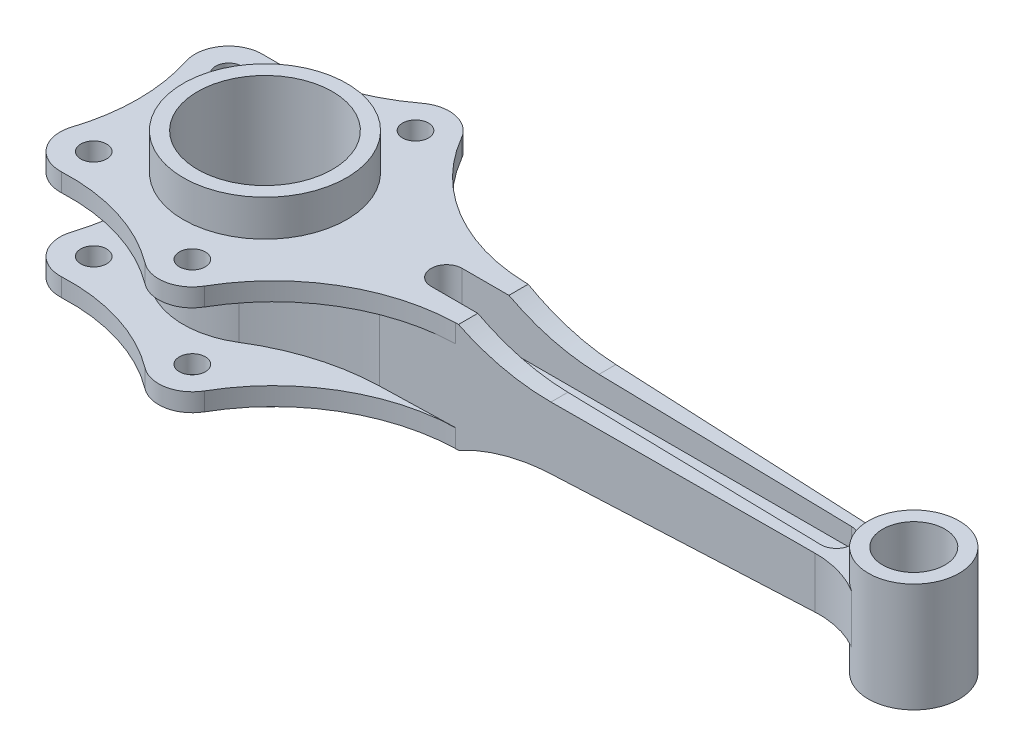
ISO-10303-21;
HEADER;
FILE_DESCRIPTION(('STEP AP214'),'2;1');
FILE_NAME('part.step','',(''),(''),'','','');
FILE_SCHEMA(('AUTOMOTIVE_DESIGN { 1 0 10303 214 1 1 1 1 }'));
ENDSEC;
DATA;
#1=APPLICATION_CONTEXT('core data for automotive mechanical design processes');
#2=APPLICATION_PROTOCOL_DEFINITION('international standard','automotive_design',2000,#1);
#3=PRODUCT_CONTEXT('',#1,'mechanical');
#4=PRODUCT('Part','Part','',(#3));
#5=PRODUCT_RELATED_PRODUCT_CATEGORY('part','',(#4));
#6=PRODUCT_DEFINITION_FORMATION('','',#4);
#7=PRODUCT_DEFINITION_CONTEXT('part definition',#1,'design');
#8=PRODUCT_DEFINITION('design','',#6,#7);
#9=PRODUCT_DEFINITION_SHAPE('','',#8);
#10=(LENGTH_UNIT() NAMED_UNIT(*) SI_UNIT(.MILLI.,.METRE.));
#11=(NAMED_UNIT(*) PLANE_ANGLE_UNIT() SI_UNIT($,.RADIAN.));
#12=(NAMED_UNIT(*) SI_UNIT($,.STERADIAN.) SOLID_ANGLE_UNIT());
#13=UNCERTAINTY_MEASURE_WITH_UNIT(LENGTH_MEASURE(1.E-05),#10,'distance_accuracy_value','');
#14=(GEOMETRIC_REPRESENTATION_CONTEXT(3) GLOBAL_UNCERTAINTY_ASSIGNED_CONTEXT((#13)) GLOBAL_UNIT_ASSIGNED_CONTEXT((#10,
#11,#12)) REPRESENTATION_CONTEXT('',''));
#15=CARTESIAN_POINT('',(0.,0.,0.));
#16=DIRECTION('',(0.,0.,1.));
#17=DIRECTION('',(1.,0.,0.));
#18=AXIS2_PLACEMENT_3D('',#15,#16,#17);
#19=CARTESIAN_POINT('',(0.411500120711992,21.,15.7145556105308));
#20=DIRECTION('',(-0.0261769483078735,0.,-0.999657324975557));
#21=DIRECTION('',(-0.999657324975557,0.,0.0261769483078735));
#22=AXIS2_PLACEMENT_3D('',#19,#20,#21);
#23=PLANE('',#22);
#24=DIRECTION('',(0.,1.,0.));
#25=VECTOR('',#24,1.);
#26=CARTESIAN_POINT('',(86.7686291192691,-21.,13.4532146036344));
#27=LINE('',#26,#25);
#28=CARTESIAN_POINT('',(86.7686291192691,-21.,13.4532146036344));
#29=VERTEX_POINT('',#28);
#30=CARTESIAN_POINT('',(86.7686291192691,-14.,13.4532146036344));
#31=VERTEX_POINT('',#30);
#32=EDGE_CURVE('E362',#29,#31,#27,.T.);
#33=ORIENTED_EDGE('',*,*,#32,.F.);
#34=DIRECTION('',(0.999657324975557,0.,-0.0261769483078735));
#35=VECTOR('',#34,1.);
#36=CARTESIAN_POINT('',(0.411500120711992,-21.,15.7145556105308));
#37=LINE('',#36,#35);
#38=CARTESIAN_POINT('',(88.,-21.,13.420970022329));
#39=VERTEX_POINT('',#38);
#40=EDGE_CURVE('E326',#29,#39,#37,.T.);
#41=ORIENTED_EDGE('',*,*,#40,.T.);
#42=CARTESIAN_POINT('',(124.408257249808,-89.9814381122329,12.4675862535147));
#43=DIRECTION('',(-0.0261769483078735,0.,-0.999657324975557));
#44=DIRECTION('',(-0.999657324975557,0.,0.0261769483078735));
#45=AXIS2_PLACEMENT_3D('',#42,#43,#44);
#46=ELLIPSE('',#45,78.0267378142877,78.);
#47=CARTESIAN_POINT('',(122.706696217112,-12.,12.5121431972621));
#48=VERTEX_POINT('',#47);
#49=EDGE_CURVE('E557',#39,#48,#46,.T.);
#50=ORIENTED_EDGE('',*,*,#49,.T.);
#51=DIRECTION('',(0.999419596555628,0.0218074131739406,-0.0261707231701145));
#52=VECTOR('',#51,1.);
#53=CARTESIAN_POINT('',(1.18888617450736,-14.6515280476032,15.6941990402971));
#54=LINE('',#53,#52);
#55=CARTESIAN_POINT('',(221.881672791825,-9.83599431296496,9.91515503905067));
#56=VERTEX_POINT('',#55);
#57=EDGE_CURVE('E575',#48,#56,#54,.T.);
#58=ORIENTED_EDGE('',*,*,#57,.T.);
#59=DIRECTION('',(0.,-1.,0.));
#60=VECTOR('',#59,1.);
#61=CARTESIAN_POINT('',(221.881672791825,21.,9.91515503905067));
#62=LINE('',#61,#60);
#63=CARTESIAN_POINT('',(221.881672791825,9.83599431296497,9.91515503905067));
#64=VERTEX_POINT('',#63);
#65=EDGE_CURVE('E645',#64,#56,#62,.T.);
#66=ORIENTED_EDGE('',*,*,#65,.F.);
#67=DIRECTION('',(0.999419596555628,-0.0218074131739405,-0.0261707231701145));
#68=VECTOR('',#67,1.);
#69=CARTESIAN_POINT('',(0.273506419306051,14.6715017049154,15.7181691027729));
#70=LINE('',#69,#68);
#71=CARTESIAN_POINT('',(122.706696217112,12.,12.5121431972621));
#72=VERTEX_POINT('',#71);
#73=EDGE_CURVE('E595',#72,#64,#70,.T.);
#74=ORIENTED_EDGE('',*,*,#73,.F.);
#75=CARTESIAN_POINT('',(124.408257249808,89.9814381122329,12.4675862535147));
#76=DIRECTION('',(-0.0261769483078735,0.,-0.999657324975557));
#77=DIRECTION('',(-0.999657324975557,0.,0.0261769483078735));
#78=AXIS2_PLACEMENT_3D('',#75,#76,#77);
#79=ELLIPSE('',#78,78.0267378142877,78.);
#80=CARTESIAN_POINT('',(88.,21.,13.420970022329));
#81=VERTEX_POINT('',#80);
#82=EDGE_CURVE('E585',#81,#72,#79,.F.);
#83=ORIENTED_EDGE('',*,*,#82,.F.);
#84=DIRECTION('',(0.999657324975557,0.,-0.0261769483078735));
#85=VECTOR('',#84,1.);
#86=CARTESIAN_POINT('',(0.411500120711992,21.,15.7145556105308));
#87=LINE('',#86,#85);
#88=CARTESIAN_POINT('',(86.7686291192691,21.,13.4532146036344));
#89=VERTEX_POINT('',#88);
#90=EDGE_CURVE('E626',#89,#81,#87,.T.);
#91=ORIENTED_EDGE('',*,*,#90,.F.);
#92=DIRECTION('',(0.,-1.,0.));
#93=VECTOR('',#92,1.);
#94=CARTESIAN_POINT('',(86.7686291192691,21.,13.4532146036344));
#95=LINE('',#94,#93);
#96=CARTESIAN_POINT('',(86.7686291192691,14.,13.4532146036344));
#97=VERTEX_POINT('',#96);
#98=EDGE_CURVE('E531',#89,#97,#95,.T.);
#99=ORIENTED_EDGE('',*,*,#98,.T.);
#100=DIRECTION('',(0.999657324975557,0.,-0.0261769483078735));
#101=VECTOR('',#100,1.);
#102=CARTESIAN_POINT('',(0.411500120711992,14.,15.7145556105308));
#103=LINE('',#102,#101);
#104=CARTESIAN_POINT('',(58.396993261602,14.,14.1961520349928));
#105=VERTEX_POINT('',#104);
#106=EDGE_CURVE('E478',#105,#97,#103,.T.);
#107=ORIENTED_EDGE('',*,*,#106,.F.);
#108=DIRECTION('',(0.,-1.,0.));
#109=VECTOR('',#108,1.);
#110=CARTESIAN_POINT('',(58.396993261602,21.,14.1961520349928));
#111=LINE('',#110,#109);
#112=CARTESIAN_POINT('',(58.396993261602,-14.,14.1961520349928));
#113=VERTEX_POINT('',#112);
#114=EDGE_CURVE('E648',#105,#113,#111,.T.);
#115=ORIENTED_EDGE('',*,*,#114,.T.);
#116=DIRECTION('',(0.999657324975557,0.,-0.0261769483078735));
#117=VECTOR('',#116,1.);
#118=CARTESIAN_POINT('',(0.411500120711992,-14.,15.7145556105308));
#119=LINE('',#118,#117);
#120=EDGE_CURVE('E51',#113,#31,#119,.T.);
#121=ORIENTED_EDGE('',*,*,#120,.T.);
#122=EDGE_LOOP('',(#33,#41,#50,#58,#66,#74,#83,#91,#99,#107,#115,#121));
#123=FACE_BOUND('',#122,.T.);
#124=ADVANCED_FACE('F34',(#123),#23,.F.);
#125=CARTESIAN_POINT('',(0.411500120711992,21.,-15.7145556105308));
#126=DIRECTION('',(0.0261769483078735,0.,-0.999657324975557));
#127=DIRECTION('',(-0.999657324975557,0.,-0.0261769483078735));
#128=AXIS2_PLACEMENT_3D('',#125,#126,#127);
#129=PLANE('',#128);
#130=DIRECTION('',(0.999657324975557,0.,0.0261769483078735));
#131=VECTOR('',#130,1.);
#132=CARTESIAN_POINT('',(0.411500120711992,-21.,-15.7145556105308));
#133=LINE('',#132,#131);
#134=CARTESIAN_POINT('',(86.7686291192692,-21.,-13.4532146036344));
#135=VERTEX_POINT('',#134);
#136=CARTESIAN_POINT('',(88.,-21.,-13.420970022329));
#137=VERTEX_POINT('',#136);
#138=EDGE_CURVE('E629',#135,#137,#133,.T.);
#139=ORIENTED_EDGE('',*,*,#138,.F.);
#140=DIRECTION('',(0.,1.,0.));
#141=VECTOR('',#140,1.);
#142=CARTESIAN_POINT('',(86.7686291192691,-21.,-13.4532146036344));
#143=LINE('',#142,#141);
#144=CARTESIAN_POINT('',(86.7686291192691,-14.,-13.4532146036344));
#145=VERTEX_POINT('',#144);
#146=EDGE_CURVE('E59',#135,#145,#143,.T.);
#147=ORIENTED_EDGE('',*,*,#146,.T.);
#148=DIRECTION('',(0.999657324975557,0.,0.0261769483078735));
#149=VECTOR('',#148,1.);
#150=CARTESIAN_POINT('',(0.411500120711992,-14.,-15.7145556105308));
#151=LINE('',#150,#149);
#152=CARTESIAN_POINT('',(58.396993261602,-14.,-14.1961520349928));
#153=VERTEX_POINT('',#152);
#154=EDGE_CURVE('E387',#153,#145,#151,.T.);
#155=ORIENTED_EDGE('',*,*,#154,.F.);
#156=DIRECTION('',(0.,-1.,0.));
#157=VECTOR('',#156,1.);
#158=CARTESIAN_POINT('',(58.396993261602,21.,-14.1961520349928));
#159=LINE('',#158,#157);
#160=CARTESIAN_POINT('',(58.396993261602,14.,-14.1961520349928));
#161=VERTEX_POINT('',#160);
#162=EDGE_CURVE('E632',#161,#153,#159,.T.);
#163=ORIENTED_EDGE('',*,*,#162,.F.);
#164=DIRECTION('',(0.999657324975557,0.,0.0261769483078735));
#165=VECTOR('',#164,1.);
#166=CARTESIAN_POINT('',(0.411500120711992,14.,-15.7145556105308));
#167=LINE('',#166,#165);
#168=CARTESIAN_POINT('',(86.7686291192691,14.,-13.4532146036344));
#169=VERTEX_POINT('',#168);
#170=EDGE_CURVE('E488',#161,#169,#167,.T.);
#171=ORIENTED_EDGE('',*,*,#170,.T.);
#172=DIRECTION('',(0.,-1.,0.));
#173=VECTOR('',#172,1.);
#174=CARTESIAN_POINT('',(86.7686291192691,21.,-13.4532146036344));
#175=LINE('',#174,#173);
#176=CARTESIAN_POINT('',(86.7686291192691,21.,-13.4532146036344));
#177=VERTEX_POINT('',#176);
#178=EDGE_CURVE('E529',#177,#169,#175,.T.);
#179=ORIENTED_EDGE('',*,*,#178,.F.);
#180=DIRECTION('',(0.999657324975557,0.,0.0261769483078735));
#181=VECTOR('',#180,1.);
#182=CARTESIAN_POINT('',(0.411500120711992,21.,-15.7145556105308));
#183=LINE('',#182,#181);
#184=CARTESIAN_POINT('',(88.,21.,-13.420970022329));
#185=VERTEX_POINT('',#184);
#186=EDGE_CURVE('E628',#177,#185,#183,.T.);
#187=ORIENTED_EDGE('',*,*,#186,.T.);
#188=CARTESIAN_POINT('',(124.408257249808,89.9814381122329,-12.4675862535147));
#189=DIRECTION('',(0.0261769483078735,0.,-0.999657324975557));
#190=DIRECTION('',(0.999657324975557,0.,0.0261769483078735));
#191=AXIS2_PLACEMENT_3D('',#188,#189,#190);
#192=ELLIPSE('',#191,78.0267378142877,78.);
#193=CARTESIAN_POINT('',(122.706696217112,12.,-12.5121431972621));
#194=VERTEX_POINT('',#193);
#195=EDGE_CURVE('E582',#185,#194,#192,.F.);
#196=ORIENTED_EDGE('',*,*,#195,.T.);
#197=DIRECTION('',(0.999419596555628,-0.0218074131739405,0.0261707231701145));
#198=VECTOR('',#197,1.);
#199=CARTESIAN_POINT('',(0.273506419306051,14.6715017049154,-15.7181691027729));
#200=LINE('',#199,#198);
#201=CARTESIAN_POINT('',(221.881672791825,9.83599431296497,-9.91515503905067));
#202=VERTEX_POINT('',#201);
#203=EDGE_CURVE('E660',#194,#202,#200,.T.);
#204=ORIENTED_EDGE('',*,*,#203,.T.);
#205=DIRECTION('',(0.,-1.,0.));
#206=VECTOR('',#205,1.);
#207=CARTESIAN_POINT('',(221.881672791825,21.,-9.91515503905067));
#208=LINE('',#207,#206);
#209=CARTESIAN_POINT('',(221.881672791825,-9.83599431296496,-9.91515503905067));
#210=VERTEX_POINT('',#209);
#211=EDGE_CURVE('E637',#202,#210,#208,.T.);
#212=ORIENTED_EDGE('',*,*,#211,.T.);
#213=DIRECTION('',(0.999419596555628,0.0218074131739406,0.0261707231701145));
#214=VECTOR('',#213,1.);
#215=CARTESIAN_POINT('',(1.18888617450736,-14.6515280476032,-15.6941990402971));
#216=LINE('',#215,#214);
#217=CARTESIAN_POINT('',(122.706696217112,-12.,-12.5121431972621));
#218=VERTEX_POINT('',#217);
#219=EDGE_CURVE('E565',#218,#210,#216,.T.);
#220=ORIENTED_EDGE('',*,*,#219,.F.);
#221=CARTESIAN_POINT('',(124.408257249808,-89.9814381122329,-12.4675862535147));
#222=DIRECTION('',(0.0261769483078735,0.,-0.999657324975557));
#223=DIRECTION('',(0.999657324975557,0.,0.0261769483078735));
#224=AXIS2_PLACEMENT_3D('',#221,#222,#223);
#225=ELLIPSE('',#224,78.0267378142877,78.);
#226=EDGE_CURVE('E555',#137,#218,#225,.T.);
#227=ORIENTED_EDGE('',*,*,#226,.F.);
#228=EDGE_LOOP('',(#139,#147,#155,#163,#171,#179,#187,#196,#204,#212,#220,#227));
#229=FACE_BOUND('',#228,.T.);
#230=ADVANCED_FACE('F743',(#229),#129,.T.);
#231=CARTESIAN_POINT('',(60.5696799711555,21.,-97.1677100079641));
#232=DIRECTION('',(0.,-1.,0.));
#233=DIRECTION('',(0.,0.,-1.));
#234=AXIS2_PLACEMENT_3D('',#231,#232,#233);
#235=CYLINDRICAL_SURFACE('',#234,83.);
#236=CARTESIAN_POINT('',(60.5696799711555,-14.,-97.1677100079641));
#237=DIRECTION('',(0.,1.,0.));
#238=DIRECTION('',(0.,0.,1.));
#239=AXIS2_PLACEMENT_3D('',#236,#237,#238);
#240=CIRCLE('',#239,83.);
#241=CARTESIAN_POINT('',(16.663274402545,-14.,-26.7317280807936));
#242=VERTEX_POINT('',#241);
#243=EDGE_CURVE('E390',#153,#242,#240,.F.);
#244=ORIENTED_EDGE('',*,*,#243,.T.);
#245=DIRECTION('',(0.,-1.,0.));
#246=VECTOR('',#245,1.);
#247=CARTESIAN_POINT('',(16.663274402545,21.,-26.7317280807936));
#248=LINE('',#247,#246);
#249=CARTESIAN_POINT('',(16.663274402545,14.,-26.7317280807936));
#250=VERTEX_POINT('',#249);
#251=EDGE_CURVE('E653',#250,#242,#248,.T.);
#252=ORIENTED_EDGE('',*,*,#251,.F.);
#253=CARTESIAN_POINT('',(60.5696799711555,14.,-97.1677100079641));
#254=DIRECTION('',(0.,1.,0.));
#255=DIRECTION('',(0.,0.,1.));
#256=AXIS2_PLACEMENT_3D('',#253,#254,#255);
#257=CIRCLE('',#256,83.);
#258=EDGE_CURVE('E486',#161,#250,#257,.F.);
#259=ORIENTED_EDGE('',*,*,#258,.F.);
#260=ORIENTED_EDGE('',*,*,#162,.T.);
#261=EDGE_LOOP('',(#244,#252,#259,#260));
#262=FACE_BOUND('',#261,.T.);
#263=ADVANCED_FACE('F36',(#262),#235,.F.);
#264=CARTESIAN_POINT('',(0.,21.,0.));
#265=DIRECTION('',(0.,-1.,0.));
#266=DIRECTION('',(0.,0.,-1.));
#267=AXIS2_PLACEMENT_3D('',#264,#265,#266);
#268=CYLINDRICAL_SURFACE('',#267,31.5);
#269=CARTESIAN_POINT('',(0.,-14.,0.));
#270=DIRECTION('',(0.,1.,0.));
#271=DIRECTION('',(0.,0.,1.));
#272=AXIS2_PLACEMENT_3D('',#269,#270,#271);
#273=CIRCLE('',#272,31.5);
#274=CARTESIAN_POINT('',(16.663274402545,-14.,26.7317280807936));
#275=VERTEX_POINT('',#274);
#276=EDGE_CURVE('E392',#242,#275,#273,.T.);
#277=ORIENTED_EDGE('',*,*,#276,.T.);
#278=DIRECTION('',(0.,-1.,0.));
#279=VECTOR('',#278,1.);
#280=CARTESIAN_POINT('',(16.663274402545,21.,26.7317280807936));
#281=LINE('',#280,#279);
#282=CARTESIAN_POINT('',(16.663274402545,14.,26.7317280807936));
#283=VERTEX_POINT('',#282);
#284=EDGE_CURVE('E650',#283,#275,#281,.T.);
#285=ORIENTED_EDGE('',*,*,#284,.F.);
#286=CARTESIAN_POINT('',(0.,14.,0.));
#287=DIRECTION('',(0.,1.,0.));
#288=DIRECTION('',(0.,0.,1.));
#289=AXIS2_PLACEMENT_3D('',#286,#287,#288);
#290=CIRCLE('',#289,31.5);
#291=EDGE_CURVE('E484',#250,#283,#290,.T.);
#292=ORIENTED_EDGE('',*,*,#291,.F.);
#293=ORIENTED_EDGE('',*,*,#251,.T.);
#294=EDGE_LOOP('',(#277,#285,#292,#293));
#295=FACE_BOUND('',#294,.T.);
#296=ADVANCED_FACE('F756',(#295),#268,.T.);
#297=CARTESIAN_POINT('',(60.5696799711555,21.,97.1677100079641));
#298=DIRECTION('',(0.,-1.,0.));
#299=DIRECTION('',(0.,0.,-1.));
#300=AXIS2_PLACEMENT_3D('',#297,#298,#299);
#301=CYLINDRICAL_SURFACE('',#300,83.);
#302=ORIENTED_EDGE('',*,*,#284,.T.);
#303=CARTESIAN_POINT('',(60.5696799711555,-14.,97.1677100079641));
#304=DIRECTION('',(0.,1.,0.));
#305=DIRECTION('',(0.,0.,1.));
#306=AXIS2_PLACEMENT_3D('',#303,#304,#305);
#307=CIRCLE('',#306,83.);
#308=EDGE_CURVE('E394',#113,#275,#307,.T.);
#309=ORIENTED_EDGE('',*,*,#308,.F.);
#310=ORIENTED_EDGE('',*,*,#114,.F.);
#311=CARTESIAN_POINT('',(60.5696799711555,14.,97.1677100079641));
#312=DIRECTION('',(0.,1.,0.));
#313=DIRECTION('',(0.,0.,1.));
#314=AXIS2_PLACEMENT_3D('',#311,#312,#313);
#315=CIRCLE('',#314,83.);
#316=EDGE_CURVE('E481',#105,#283,#315,.T.);
#317=ORIENTED_EDGE('',*,*,#316,.T.);
#318=EDGE_LOOP('',(#302,#309,#310,#317));
#319=FACE_BOUND('',#318,.T.);
#320=ADVANCED_FACE('F753',(#319),#301,.F.);
#321=CARTESIAN_POINT('',(0.,21.,0.));
#322=DIRECTION('',(0.,1.,0.));
#323=DIRECTION('',(0.,0.,1.));
#324=AXIS2_PLACEMENT_3D('',#321,#322,#323);
#325=PLANE('',#324);
#326=CARTESIAN_POINT('',(-40.,21.,-26.));
#327=DIRECTION('',(0.,1.,0.));
#328=DIRECTION('',(0.,0.,1.));
#329=AXIS2_PLACEMENT_3D('',#326,#327,#328);
#330=CIRCLE('',#329,5.);
#331=CARTESIAN_POINT('',(-40.,21.,-21.));
#332=VERTEX_POINT('',#331);
#333=EDGE_CURVE('E684',#332,#332,#330,.T.);
#334=ORIENTED_EDGE('',*,*,#333,.F.);
#335=EDGE_LOOP('',(#334));
#336=FACE_BOUND('',#335,.T.);
#337=CARTESIAN_POINT('',(-40.,21.,26.));
#338=DIRECTION('',(0.,1.,0.));
#339=DIRECTION('',(0.,0.,1.));
#340=AXIS2_PLACEMENT_3D('',#337,#338,#339);
#341=CIRCLE('',#340,5.);
#342=CARTESIAN_POINT('',(-40.,21.,31.));
#343=VERTEX_POINT('',#342);
#344=EDGE_CURVE('E1407',#343,#343,#341,.T.);
#345=ORIENTED_EDGE('',*,*,#344,.F.);
#346=EDGE_LOOP('',(#345));
#347=FACE_BOUND('',#346,.T.);
#348=CARTESIAN_POINT('',(15.,21.,43.));
#349=DIRECTION('',(0.,1.,0.));
#350=DIRECTION('',(0.,0.,1.));
#351=AXIS2_PLACEMENT_3D('',#348,#349,#350);
#352=CIRCLE('',#351,5.);
#353=CARTESIAN_POINT('',(15.,21.,48.));
#354=VERTEX_POINT('',#353);
#355=EDGE_CURVE('E1410',#354,#354,#352,.T.);
#356=ORIENTED_EDGE('',*,*,#355,.F.);
#357=EDGE_LOOP('',(#356));
#358=FACE_BOUND('',#357,.T.);
#359=CARTESIAN_POINT('',(15.,21.,-43.));
#360=DIRECTION('',(0.,1.,0.));
#361=DIRECTION('',(0.,0.,1.));
#362=AXIS2_PLACEMENT_3D('',#359,#360,#361);
#363=CIRCLE('',#362,5.);
#364=CARTESIAN_POINT('',(15.,21.,-38.));
#365=VERTEX_POINT('',#364);
#366=EDGE_CURVE('E680',#365,#365,#363,.T.);
#367=ORIENTED_EDGE('',*,*,#366,.F.);
#368=EDGE_LOOP('',(#367));
#369=FACE_BOUND('',#368,.T.);
#370=CARTESIAN_POINT('',(0.,21.,0.));
#371=DIRECTION('',(0.,1.,0.));
#372=DIRECTION('',(0.,0.,1.));
#373=AXIS2_PLACEMENT_3D('',#370,#371,#372);
#374=CIRCLE('',#373,31.5);
#375=CARTESIAN_POINT('',(0.,21.,31.5));
#376=VERTEX_POINT('',#375);
#377=EDGE_CURVE('E442',#376,#376,#374,.T.);
#378=ORIENTED_EDGE('',*,*,#377,.F.);
#379=EDGE_LOOP('',(#378));
#380=FACE_BOUND('',#379,.T.);
#381=DIRECTION('',(0.,0.,1.));
#382=VECTOR('',#381,1.);
#383=CARTESIAN_POINT('',(88.,21.,-31.5));
#384=LINE('',#383,#382);
#385=CARTESIAN_POINT('',(88.,21.,6.));
#386=VERTEX_POINT('',#385);
#387=EDGE_CURVE('E657',#81,#386,#384,.F.);
#388=ORIENTED_EDGE('',*,*,#387,.T.);
#389=DIRECTION('',(-1.,0.,0.));
#390=VECTOR('',#389,1.);
#391=CARTESIAN_POINT('',(0.,21.,6.));
#392=LINE('',#391,#390);
#393=CARTESIAN_POINT('',(70.,21.,6.));
#394=VERTEX_POINT('',#393);
#395=EDGE_CURVE('E439',#386,#394,#392,.T.);
#396=ORIENTED_EDGE('',*,*,#395,.T.);
#397=CARTESIAN_POINT('',(70.,21.,0.));
#398=DIRECTION('',(0.,1.,0.));
#399=DIRECTION('',(0.,0.,1.));
#400=AXIS2_PLACEMENT_3D('',#397,#398,#399);
#401=CIRCLE('',#400,6.);
#402=CARTESIAN_POINT('',(70.,21.,-6.));
#403=VERTEX_POINT('',#402);
#404=EDGE_CURVE('E11',#394,#403,#401,.F.);
#405=ORIENTED_EDGE('',*,*,#404,.T.);
#406=DIRECTION('',(-1.,0.,0.));
#407=VECTOR('',#406,1.);
#408=CARTESIAN_POINT('',(0.,21.,-6.));
#409=LINE('',#408,#407);
#410=CARTESIAN_POINT('',(88.,21.,-6.));
#411=VERTEX_POINT('',#410);
#412=EDGE_CURVE('E434',#411,#403,#409,.T.);
#413=ORIENTED_EDGE('',*,*,#412,.F.);
#414=EDGE_CURVE('E656',#411,#185,#384,.F.);
#415=ORIENTED_EDGE('',*,*,#414,.T.);
#416=ORIENTED_EDGE('',*,*,#186,.F.);
#417=CARTESIAN_POINT('',(88.6533693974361,21.,-85.4285420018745));
#418=DIRECTION('',(0.,1.,0.));
#419=DIRECTION('',(0.,0.,1.));
#420=AXIS2_PLACEMENT_3D('',#417,#418,#419);
#421=CIRCLE('',#420,72.);
#422=CARTESIAN_POINT('',(26.2646329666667,21.,-49.4890711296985));
#423=VERTEX_POINT('',#422);
#424=EDGE_CURVE('E455',#423,#177,#421,.T.);
#425=ORIENTED_EDGE('',*,*,#424,.F.);
#426=CARTESIAN_POINT('',(15.,21.,-43.));
#427=DIRECTION('',(0.,1.,0.));
#428=DIRECTION('',(0.,0.,1.));
#429=AXIS2_PLACEMENT_3D('',#426,#427,#428);
#430=CIRCLE('',#429,13.);
#431=CARTESIAN_POINT('',(7.18194667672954,21.,-53.3864354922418));
#432=VERTEX_POINT('',#431);
#433=EDGE_CURVE('E458',#423,#432,#430,.T.);
#434=ORIENTED_EDGE('',*,*,#433,.T.);
#435=CARTESIAN_POINT('',(-36.1180409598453,21.,-110.911308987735));
#436=DIRECTION('',(0.,1.,0.));
#437=DIRECTION('',(0.,0.,1.));
#438=AXIS2_PLACEMENT_3D('',#435,#436,#437);
#439=CIRCLE('',#438,72.);
#440=CARTESIAN_POINT('',(-39.4062886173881,21.,-38.9864354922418));
#441=VERTEX_POINT('',#440);
#442=EDGE_CURVE('E460',#441,#432,#439,.T.);
#443=ORIENTED_EDGE('',*,*,#442,.F.);
#444=CARTESIAN_POINT('',(-40.,21.,-26.));
#445=DIRECTION('',(0.,1.,0.));
#446=DIRECTION('',(0.,0.,1.));
#447=AXIS2_PLACEMENT_3D('',#444,#445,#446);
#448=CIRCLE('',#447,13.);
#449=CARTESIAN_POINT('',(-52.3769011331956,21.,-22.0235294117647));
#450=VERTEX_POINT('',#449);
#451=EDGE_CURVE('E463',#441,#450,#448,.T.);
#452=ORIENTED_EDGE('',*,*,#451,.T.);
#453=CARTESIAN_POINT('',(-120.925892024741,21.,0.));
#454=DIRECTION('',(0.,1.,0.));
#455=DIRECTION('',(0.,0.,1.));
#456=AXIS2_PLACEMENT_3D('',#453,#454,#455);
#457=CIRCLE('',#456,72.);
#458=CARTESIAN_POINT('',(-52.3769011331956,21.,22.0235294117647));
#459=VERTEX_POINT('',#458);
#460=EDGE_CURVE('E465',#459,#450,#457,.T.);
#461=ORIENTED_EDGE('',*,*,#460,.F.);
#462=CARTESIAN_POINT('',(-40.,21.,26.));
#463=DIRECTION('',(0.,1.,0.));
#464=DIRECTION('',(0.,0.,1.));
#465=AXIS2_PLACEMENT_3D('',#462,#463,#464);
#466=CIRCLE('',#465,13.);
#467=CARTESIAN_POINT('',(-39.4062886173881,21.,38.9864354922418));
#468=VERTEX_POINT('',#467);
#469=EDGE_CURVE('E468',#459,#468,#466,.T.);
#470=ORIENTED_EDGE('',*,*,#469,.T.);
#471=CARTESIAN_POINT('',(-36.1180409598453,21.,110.911308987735));
#472=DIRECTION('',(0.,1.,0.));
#473=DIRECTION('',(0.,0.,1.));
#474=AXIS2_PLACEMENT_3D('',#471,#472,#473);
#475=CIRCLE('',#474,72.);
#476=CARTESIAN_POINT('',(7.18194667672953,21.,53.3864354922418));
#477=VERTEX_POINT('',#476);
#478=EDGE_CURVE('E470',#477,#468,#475,.T.);
#479=ORIENTED_EDGE('',*,*,#478,.F.);
#480=CARTESIAN_POINT('',(15.,21.,43.));
#481=DIRECTION('',(0.,1.,0.));
#482=DIRECTION('',(0.,0.,1.));
#483=AXIS2_PLACEMENT_3D('',#480,#481,#482);
#484=CIRCLE('',#483,13.);
#485=CARTESIAN_POINT('',(26.2646329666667,21.,49.4890711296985));
#486=VERTEX_POINT('',#485);
#487=EDGE_CURVE('E473',#477,#486,#484,.T.);
#488=ORIENTED_EDGE('',*,*,#487,.T.);
#489=CARTESIAN_POINT('',(88.653369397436,21.,85.4285420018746));
#490=DIRECTION('',(0.,1.,0.));
#491=DIRECTION('',(0.,0.,1.));
#492=AXIS2_PLACEMENT_3D('',#489,#490,#491);
#493=CIRCLE('',#492,72.);
#494=EDGE_CURVE('E452',#89,#486,#493,.T.);
#495=ORIENTED_EDGE('',*,*,#494,.F.);
#496=ORIENTED_EDGE('',*,*,#90,.T.);
#497=EDGE_LOOP('',(#388,#396,#405,#413,#415,#416,#425,#434,#443,#452,#461,#470,#479,#488,#495,#496));
#498=FACE_BOUND('',#497,.T.);
#499=ADVANCED_FACE('F755',(#336,#347,#358,#369,#380,#498),#325,.T.);
#500=CARTESIAN_POINT('',(0.320111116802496,14.6704847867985,-31.5));
#501=DIRECTION('',(0.0218148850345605,0.999762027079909,0.));
#502=DIRECTION('',(-0.999762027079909,0.0218148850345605,0.));
#503=AXIS2_PLACEMENT_3D('',#500,#501,#502);
#504=PLANE('',#503);
#505=CARTESIAN_POINT('',(220.,9.87705255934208,0.));
#506=DIRECTION('',(0.0218148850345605,0.999762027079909,0.));
#507=DIRECTION('',(0.999762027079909,-0.0218148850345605,0.));
#508=AXIS2_PLACEMENT_3D('',#505,#506,#507);
#509=ELLIPSE('',#508,6.00142817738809,6.);
#510=CARTESIAN_POINT('',(220.,9.87705255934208,-6.));
#511=VERTEX_POINT('',#510);
#512=CARTESIAN_POINT('',(220.,9.87705255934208,6.));
#513=VERTEX_POINT('',#512);
#514=EDGE_CURVE('E43',#511,#513,#509,.F.);
#515=ORIENTED_EDGE('',*,*,#514,.T.);
#516=DIRECTION('',(-0.999762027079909,0.0218148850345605,0.));
#517=VECTOR('',#516,1.);
#518=CARTESIAN_POINT('',(0.320111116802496,14.6704847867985,6.));
#519=LINE('',#518,#517);
#520=CARTESIAN_POINT('',(122.706696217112,12.,6.));
#521=VERTEX_POINT('',#520);
#522=EDGE_CURVE('E436',#513,#521,#519,.T.);
#523=ORIENTED_EDGE('',*,*,#522,.T.);
#524=DIRECTION('',(0.,0.,1.));
#525=VECTOR('',#524,1.);
#526=CARTESIAN_POINT('',(122.706696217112,12.,-31.5));
#527=LINE('',#526,#525);
#528=EDGE_CURVE('E578',#521,#72,#527,.T.);
#529=ORIENTED_EDGE('',*,*,#528,.T.);
#530=ORIENTED_EDGE('',*,*,#73,.T.);
#531=CARTESIAN_POINT('',(222.797865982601,9.81600290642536,44.9031614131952));
#532=DIRECTION('',(0.0218148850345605,0.999762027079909,0.));
#533=DIRECTION('',(0.999762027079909,-0.0218148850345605,0.));
#534=AXIS2_PLACEMENT_3D('',#531,#532,#533);
#535=ELLIPSE('',#534,35.0083310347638,35.);
#536=CARTESIAN_POINT('',(240.9326219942,9.42030112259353,14.967720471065));
#537=VERTEX_POINT('',#536);
#538=EDGE_CURVE('E592',#537,#64,#535,.T.);
#539=ORIENTED_EDGE('',*,*,#538,.F.);
#540=CARTESIAN_POINT('',(250.,9.22245023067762,0.));
#541=DIRECTION('',(0.0218148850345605,0.999762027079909,0.));
#542=DIRECTION('',(0.999762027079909,-0.0218148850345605,0.));
#543=AXIS2_PLACEMENT_3D('',#540,#541,#542);
#544=ELLIPSE('',#543,17.5041655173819,17.5);
#545=CARTESIAN_POINT('',(240.9326219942,9.42030112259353,-14.967720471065));
#546=VERTEX_POINT('',#545);
#547=EDGE_CURVE('E590',#546,#537,#544,.T.);
#548=ORIENTED_EDGE('',*,*,#547,.F.);
#549=CARTESIAN_POINT('',(222.797865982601,9.81600290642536,-44.9031614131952));
#550=DIRECTION('',(0.0218148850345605,0.999762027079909,0.));
#551=DIRECTION('',(0.999762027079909,-0.0218148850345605,0.));
#552=AXIS2_PLACEMENT_3D('',#549,#550,#551);
#553=ELLIPSE('',#552,35.0083310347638,35.);
#554=EDGE_CURVE('E588',#546,#202,#553,.F.);
#555=ORIENTED_EDGE('',*,*,#554,.T.);
#556=ORIENTED_EDGE('',*,*,#203,.F.);
#557=CARTESIAN_POINT('',(122.706696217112,12.,-6.));
#558=VERTEX_POINT('',#557);
#559=EDGE_CURVE('E579',#194,#558,#527,.T.);
#560=ORIENTED_EDGE('',*,*,#559,.T.);
#561=DIRECTION('',(-0.999762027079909,0.0218148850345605,0.));
#562=VECTOR('',#561,1.);
#563=CARTESIAN_POINT('',(0.320111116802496,14.6704847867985,-6.));
#564=LINE('',#563,#562);
#565=EDGE_CURVE('E427',#511,#558,#564,.T.);
#566=ORIENTED_EDGE('',*,*,#565,.F.);
#567=EDGE_LOOP('',(#515,#523,#529,#530,#539,#548,#555,#556,#560,#566));
#568=FACE_BOUND('',#567,.T.);
#569=ADVANCED_FACE('F824',(#568),#504,.T.);
#570=CARTESIAN_POINT('',(124.408257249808,89.9814381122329,-31.5));
#571=DIRECTION('',(0.,0.,1.));
#572=DIRECTION('',(1.,0.,0.));
#573=AXIS2_PLACEMENT_3D('',#570,#571,#572);
#574=CYLINDRICAL_SURFACE('',#573,78.);
#575=ORIENTED_EDGE('',*,*,#528,.F.);
#576=CARTESIAN_POINT('',(124.408257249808,89.9814381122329,6.));
#577=DIRECTION('',(0.,0.,-1.));
#578=DIRECTION('',(-1.,0.,0.));
#579=AXIS2_PLACEMENT_3D('',#576,#577,#578);
#580=CIRCLE('',#579,78.);
#581=EDGE_CURVE('E671',#521,#386,#580,.T.);
#582=ORIENTED_EDGE('',*,*,#581,.T.);
#583=ORIENTED_EDGE('',*,*,#387,.F.);
#584=ORIENTED_EDGE('',*,*,#82,.T.);
#585=EDGE_LOOP('',(#575,#582,#583,#584));
#586=FACE_BOUND('',#585,.T.);
#587=ADVANCED_FACE('F878',(#586),#574,.F.);
#588=CARTESIAN_POINT('',(222.797865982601,21.,44.9031614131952));
#589=DIRECTION('',(0.,-1.,0.));
#590=DIRECTION('',(0.,0.,-1.));
#591=AXIS2_PLACEMENT_3D('',#588,#589,#590);
#592=CYLINDRICAL_SURFACE('',#591,35.);
#593=CARTESIAN_POINT('',(222.797865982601,-9.81600290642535,44.9031614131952));
#594=DIRECTION('',(-0.0218148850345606,0.999762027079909,0.));
#595=DIRECTION('',(-0.999762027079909,-0.0218148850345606,0.));
#596=AXIS2_PLACEMENT_3D('',#593,#594,#595);
#597=ELLIPSE('',#596,35.0083310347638,35.);
#598=CARTESIAN_POINT('',(240.9326219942,-9.42030112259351,14.967720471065));
#599=VERTEX_POINT('',#598);
#600=EDGE_CURVE('E573',#599,#56,#597,.T.);
#601=ORIENTED_EDGE('',*,*,#600,.F.);
#602=DIRECTION('',(0.,-1.,0.));
#603=VECTOR('',#602,1.);
#604=CARTESIAN_POINT('',(240.9326219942,21.,14.9677204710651));
#605=LINE('',#604,#603);
#606=EDGE_CURVE('E643',#537,#599,#605,.T.);
#607=ORIENTED_EDGE('',*,*,#606,.F.);
#608=ORIENTED_EDGE('',*,*,#538,.T.);
#609=ORIENTED_EDGE('',*,*,#65,.T.);
#610=EDGE_LOOP('',(#601,#607,#608,#609));
#611=FACE_BOUND('',#610,.T.);
#612=ADVANCED_FACE('F751',(#611),#592,.F.);
#613=CARTESIAN_POINT('',(222.797865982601,21.,-44.9031614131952));
#614=DIRECTION('',(0.,-1.,0.));
#615=DIRECTION('',(0.,0.,-1.));
#616=AXIS2_PLACEMENT_3D('',#613,#614,#615);
#617=CYLINDRICAL_SURFACE('',#616,35.);
#618=DIRECTION('',(0.,-1.,0.));
#619=VECTOR('',#618,1.);
#620=CARTESIAN_POINT('',(240.9326219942,21.,-14.9677204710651));
#621=LINE('',#620,#619);
#622=CARTESIAN_POINT('',(240.9326219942,-9.42030112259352,-14.9677204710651));
#623=VERTEX_POINT('',#622);
#624=EDGE_CURVE('E640',#546,#623,#621,.T.);
#625=ORIENTED_EDGE('',*,*,#624,.T.);
#626=CARTESIAN_POINT('',(222.797865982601,-9.81600290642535,-44.9031614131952));
#627=DIRECTION('',(-0.0218148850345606,0.999762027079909,0.));
#628=DIRECTION('',(-0.999762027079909,-0.0218148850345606,0.));
#629=AXIS2_PLACEMENT_3D('',#626,#627,#628);
#630=ELLIPSE('',#629,35.0083310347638,35.);
#631=EDGE_CURVE('E567',#623,#210,#630,.F.);
#632=ORIENTED_EDGE('',*,*,#631,.T.);
#633=ORIENTED_EDGE('',*,*,#211,.F.);
#634=ORIENTED_EDGE('',*,*,#554,.F.);
#635=EDGE_LOOP('',(#625,#632,#633,#634));
#636=FACE_BOUND('',#635,.T.);
#637=ADVANCED_FACE('F816',(#636),#617,.F.);
#638=CARTESIAN_POINT('',(0.,21.,0.));
#639=DIRECTION('',(0.,-1.,0.));
#640=DIRECTION('',(0.,0.,-1.));
#641=AXIS2_PLACEMENT_3D('',#638,#639,#640);
#642=CYLINDRICAL_SURFACE('',#641,26.);
#643=CARTESIAN_POINT('',(0.,35.,0.));
#644=DIRECTION('',(0.,1.,0.));
#645=DIRECTION('',(0.,0.,1.));
#646=AXIS2_PLACEMENT_3D('',#643,#644,#645);
#647=CIRCLE('',#646,26.);
#648=CARTESIAN_POINT('',(0.,35.,-26.));
#649=VERTEX_POINT('',#648);
#650=EDGE_CURVE('E443',#649,#649,#647,.T.);
#651=CARTESIAN_POINT('',(0.,-35.,0.));
#652=DIRECTION('',(0.,1.,0.));
#653=DIRECTION('',(0.,0.,1.));
#654=AXIS2_PLACEMENT_3D('',#651,#652,#653);
#655=CIRCLE('',#654,26.);
#656=CARTESIAN_POINT('',(0.,-35.,-26.));
#657=VERTEX_POINT('',#656);
#658=EDGE_CURVE('E718',#657,#657,#655,.T.);
#659=CARTESIAN_POINT('',(0.,35.,-26.));
#660=CARTESIAN_POINT('',(0.,34.2708333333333,-26.));
#661=CARTESIAN_POINT('',(0.,33.5416666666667,-26.));
#662=CARTESIAN_POINT('',(0.,32.0833333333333,-26.));
#663=CARTESIAN_POINT('',(0.,31.3541666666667,-26.));
#664=CARTESIAN_POINT('',(0.,29.8958333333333,-26.));
#665=CARTESIAN_POINT('',(0.,29.1666666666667,-26.));
#666=CARTESIAN_POINT('',(0.,27.7083333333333,-26.));
#667=CARTESIAN_POINT('',(0.,26.9791666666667,-26.));
#668=CARTESIAN_POINT('',(0.,25.5208333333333,-26.));
#669=CARTESIAN_POINT('',(0.,24.7916666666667,-26.));
#670=CARTESIAN_POINT('',(0.,23.3333333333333,-26.));
#671=CARTESIAN_POINT('',(0.,22.6041666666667,-26.));
#672=CARTESIAN_POINT('',(0.,21.1458333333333,-26.));
#673=CARTESIAN_POINT('',(0.,20.4166666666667,-26.));
#674=CARTESIAN_POINT('',(0.,18.9583333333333,-26.));
#675=CARTESIAN_POINT('',(0.,18.2291666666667,-26.));
#676=CARTESIAN_POINT('',(0.,16.7708333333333,-26.));
#677=CARTESIAN_POINT('',(0.,16.0416666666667,-26.));
#678=CARTESIAN_POINT('',(0.,14.5833333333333,-26.));
#679=CARTESIAN_POINT('',(0.,13.8541666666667,-26.));
#680=CARTESIAN_POINT('',(0.,12.3958333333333,-26.));
#681=CARTESIAN_POINT('',(0.,11.6666666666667,-26.));
#682=CARTESIAN_POINT('',(0.,10.2083333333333,-26.));
#683=CARTESIAN_POINT('',(0.,9.47916666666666,-26.));
#684=CARTESIAN_POINT('',(0.,8.02083333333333,-26.));
#685=CARTESIAN_POINT('',(0.,7.29166666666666,-26.));
#686=CARTESIAN_POINT('',(0.,5.83333333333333,-26.));
#687=CARTESIAN_POINT('',(0.,5.10416666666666,-26.));
#688=CARTESIAN_POINT('',(0.,3.64583333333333,-26.));
#689=CARTESIAN_POINT('',(0.,2.91666666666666,-26.));
#690=CARTESIAN_POINT('',(0.,1.45833333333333,-26.));
#691=CARTESIAN_POINT('',(0.,0.72916666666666,-26.));
#692=CARTESIAN_POINT('',(0.,-0.729166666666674,-26.));
#693=CARTESIAN_POINT('',(0.,-1.45833333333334,-26.));
#694=CARTESIAN_POINT('',(0.,-2.91666666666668,-26.));
#695=CARTESIAN_POINT('',(0.,-3.64583333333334,-26.));
#696=CARTESIAN_POINT('',(0.,-5.10416666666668,-26.));
#697=CARTESIAN_POINT('',(0.,-5.83333333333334,-26.));
#698=CARTESIAN_POINT('',(0.,-7.29166666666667,-26.));
#699=CARTESIAN_POINT('',(0.,-8.02083333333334,-26.));
#700=CARTESIAN_POINT('',(0.,-9.47916666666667,-26.));
#701=CARTESIAN_POINT('',(0.,-10.2083333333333,-26.));
#702=CARTESIAN_POINT('',(0.,-11.6666666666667,-26.));
#703=CARTESIAN_POINT('',(0.,-12.3958333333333,-26.));
#704=CARTESIAN_POINT('',(0.,-13.8541666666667,-26.));
#705=CARTESIAN_POINT('',(0.,-14.5833333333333,-26.));
#706=CARTESIAN_POINT('',(0.,-16.0416666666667,-26.));
#707=CARTESIAN_POINT('',(0.,-16.7708333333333,-26.));
#708=CARTESIAN_POINT('',(0.,-18.2291666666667,-26.));
#709=CARTESIAN_POINT('',(0.,-18.9583333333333,-26.));
#710=CARTESIAN_POINT('',(0.,-20.4166666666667,-26.));
#711=CARTESIAN_POINT('',(0.,-21.1458333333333,-26.));
#712=CARTESIAN_POINT('',(0.,-22.6041666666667,-26.));
#713=CARTESIAN_POINT('',(0.,-23.3333333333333,-26.));
#714=CARTESIAN_POINT('',(0.,-24.7916666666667,-26.));
#715=CARTESIAN_POINT('',(0.,-25.5208333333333,-26.));
#716=CARTESIAN_POINT('',(0.,-26.9791666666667,-26.));
#717=CARTESIAN_POINT('',(0.,-27.7083333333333,-26.));
#718=CARTESIAN_POINT('',(0.,-29.1666666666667,-26.));
#719=CARTESIAN_POINT('',(0.,-29.8958333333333,-26.));
#720=CARTESIAN_POINT('',(0.,-31.3541666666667,-26.));
#721=CARTESIAN_POINT('',(0.,-32.0833333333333,-26.));
#722=CARTESIAN_POINT('',(0.,-33.5416666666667,-26.));
#723=CARTESIAN_POINT('',(0.,-34.2708333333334,-26.));
#724=CARTESIAN_POINT('',(0.,-35.,-26.));
#725=B_SPLINE_CURVE_WITH_KNOTS('',3,(#659,#660,#661,#662,#663,#664,#665,#666,#667,#668,#669,
#670,#671,#672,#673,#674,#675,#676,#677,#678,#679,#680,#681,#682,#683,#684,#685,#686,#687,#688,
#689,#690,#691,#692,#693,#694,#695,#696,#697,#698,#699,#700,#701,#702,#703,#704,#705,#706,#707,
#708,#709,#710,#711,#712,#713,#714,#715,#716,#717,#718,#719,#720,#721,#722,#723,#724),
.UNSPECIFIED.,.F.,.F.,(4,2,2,2,2,2,2,2,2,2,2,2,2,2,2,2,2,2,2,2,2,2,2,2,2,2,2,2,2,2,2,2,4),(0.,
2.1875,4.375,6.5625,8.75,10.9375,13.125,15.3125,17.5,19.6875,21.875,24.0625,26.25,28.4375,
30.625,32.8125,35.,37.1875,39.375,41.5625,43.75,45.9375,48.125,50.3125,52.5,54.6875,56.875,
59.0625,61.25,63.4375,65.625,67.8125,70.),.UNSPECIFIED.);
#726=EDGE_CURVE('BSEAM870',#649,#657,#725,.T.);
#727=ORIENTED_EDGE('',*,*,#650,.T.);
#728=ORIENTED_EDGE('',*,*,#658,.F.);
#729=ORIENTED_EDGE('',*,*,#726,.T.);
#730=ORIENTED_EDGE('',*,*,#726,.F.);
#731=EDGE_LOOP('',(#727,#729,#728,#730));
#732=FACE_BOUND('',#731,.T.);
#733=ADVANCED_FACE('F870',(#732),#642,.F.);
#734=CARTESIAN_POINT('',(0.,-21.,0.));
#735=DIRECTION('',(0.,1.,0.));
#736=DIRECTION('',(0.,0.,1.));
#737=AXIS2_PLACEMENT_3D('',#734,#735,#736);
#738=PLANE('',#737);
#739=CARTESIAN_POINT('',(-40.,-21.,-26.));
#740=DIRECTION('',(0.,1.,0.));
#741=DIRECTION('',(0.,0.,1.));
#742=AXIS2_PLACEMENT_3D('',#739,#740,#741);
#743=CIRCLE('',#742,5.);
#744=CARTESIAN_POINT('',(-40.,-21.,-21.));
#745=VERTEX_POINT('',#744);
#746=EDGE_CURVE('E707',#745,#745,#743,.T.);
#747=ORIENTED_EDGE('',*,*,#746,.T.);
#748=EDGE_LOOP('',(#747));
#749=FACE_BOUND('',#748,.T.);
#750=CARTESIAN_POINT('',(-40.,-21.,26.));
#751=DIRECTION('',(0.,1.,0.));
#752=DIRECTION('',(0.,0.,1.));
#753=AXIS2_PLACEMENT_3D('',#750,#751,#752);
#754=CIRCLE('',#753,5.);
#755=CARTESIAN_POINT('',(-40.,-21.,31.));
#756=VERTEX_POINT('',#755);
#757=EDGE_CURVE('E692',#756,#756,#754,.T.);
#758=ORIENTED_EDGE('',*,*,#757,.T.);
#759=EDGE_LOOP('',(#758));
#760=FACE_BOUND('',#759,.T.);
#761=CARTESIAN_POINT('',(15.,-21.,43.));
#762=DIRECTION('',(0.,1.,0.));
#763=DIRECTION('',(0.,0.,1.));
#764=AXIS2_PLACEMENT_3D('',#761,#762,#763);
#765=CIRCLE('',#764,5.);
#766=CARTESIAN_POINT('',(15.,-21.,48.));
#767=VERTEX_POINT('',#766);
#768=EDGE_CURVE('E688',#767,#767,#765,.T.);
#769=ORIENTED_EDGE('',*,*,#768,.T.);
#770=EDGE_LOOP('',(#769));
#771=FACE_BOUND('',#770,.T.);
#772=CARTESIAN_POINT('',(15.,-21.,-43.));
#773=DIRECTION('',(0.,1.,0.));
#774=DIRECTION('',(0.,0.,1.));
#775=AXIS2_PLACEMENT_3D('',#772,#773,#774);
#776=CIRCLE('',#775,5.);
#777=CARTESIAN_POINT('',(15.,-21.,-38.));
#778=VERTEX_POINT('',#777);
#779=EDGE_CURVE('E714',#778,#778,#776,.T.);
#780=ORIENTED_EDGE('',*,*,#779,.T.);
#781=EDGE_LOOP('',(#780));
#782=FACE_BOUND('',#781,.T.);
#783=CARTESIAN_POINT('',(0.,-21.,0.));
#784=DIRECTION('',(0.,1.,0.));
#785=DIRECTION('',(0.,0.,1.));
#786=AXIS2_PLACEMENT_3D('',#783,#784,#785);
#787=CIRCLE('',#786,31.5);
#788=CARTESIAN_POINT('',(0.,-21.,31.5));
#789=VERTEX_POINT('',#788);
#790=EDGE_CURVE('E717',#789,#789,#787,.T.);
#791=ORIENTED_EDGE('',*,*,#790,.T.);
#792=EDGE_LOOP('',(#791));
#793=FACE_BOUND('',#792,.T.);
#794=CARTESIAN_POINT('',(88.6533693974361,-21.,-85.4285420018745));
#795=DIRECTION('',(0.,1.,0.));
#796=DIRECTION('',(0.,0.,1.));
#797=AXIS2_PLACEMENT_3D('',#794,#795,#796);
#798=CIRCLE('',#797,72.);
#799=CARTESIAN_POINT('',(26.2646329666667,-21.,-49.4890711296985));
#800=VERTEX_POINT('',#799);
#801=EDGE_CURVE('E360',#800,#135,#798,.T.);
#802=ORIENTED_EDGE('',*,*,#801,.T.);
#803=ORIENTED_EDGE('',*,*,#138,.T.);
#804=DIRECTION('',(0.,0.,1.));
#805=VECTOR('',#804,1.);
#806=CARTESIAN_POINT('',(88.,-21.,-31.5));
#807=LINE('',#806,#805);
#808=CARTESIAN_POINT('',(88.,-21.,-6.));
#809=VERTEX_POINT('',#808);
#810=EDGE_CURVE('E549',#137,#809,#807,.T.);
#811=ORIENTED_EDGE('',*,*,#810,.T.);
#812=DIRECTION('',(1.,0.,0.));
#813=VECTOR('',#812,1.);
#814=CARTESIAN_POINT('',(70.,-21.,-6.));
#815=LINE('',#814,#813);
#816=CARTESIAN_POINT('',(70.,-21.,-6.));
#817=VERTEX_POINT('',#816);
#818=EDGE_CURVE('E605',#817,#809,#815,.T.);
#819=ORIENTED_EDGE('',*,*,#818,.F.);
#820=CARTESIAN_POINT('',(70.,-21.,0.));
#821=DIRECTION('',(0.,1.,0.));
#822=DIRECTION('',(0.,0.,1.));
#823=AXIS2_PLACEMENT_3D('',#820,#821,#822);
#824=CIRCLE('',#823,6.);
#825=CARTESIAN_POINT('',(70.,-21.,6.));
#826=VERTEX_POINT('',#825);
#827=EDGE_CURVE('E598',#817,#826,#824,.T.);
#828=ORIENTED_EDGE('',*,*,#827,.T.);
#829=DIRECTION('',(1.,0.,0.));
#830=VECTOR('',#829,1.);
#831=CARTESIAN_POINT('',(70.,-21.,6.));
#832=LINE('',#831,#830);
#833=CARTESIAN_POINT('',(88.,-21.,6.));
#834=VERTEX_POINT('',#833);
#835=EDGE_CURVE('E601',#826,#834,#832,.T.);
#836=ORIENTED_EDGE('',*,*,#835,.T.);
#837=EDGE_CURVE('E547',#834,#39,#807,.T.);
#838=ORIENTED_EDGE('',*,*,#837,.T.);
#839=ORIENTED_EDGE('',*,*,#40,.F.);
#840=CARTESIAN_POINT('',(88.653369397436,-21.,85.4285420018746));
#841=DIRECTION('',(0.,1.,0.));
#842=DIRECTION('',(0.,0.,1.));
#843=AXIS2_PLACEMENT_3D('',#840,#841,#842);
#844=CIRCLE('',#843,72.);
#845=CARTESIAN_POINT('',(26.2646329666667,-21.,49.4890711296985));
#846=VERTEX_POINT('',#845);
#847=EDGE_CURVE('E319',#29,#846,#844,.T.);
#848=ORIENTED_EDGE('',*,*,#847,.T.);
#849=CARTESIAN_POINT('',(15.,-21.,43.));
#850=DIRECTION('',(0.,1.,0.));
#851=DIRECTION('',(0.,0.,1.));
#852=AXIS2_PLACEMENT_3D('',#849,#850,#851);
#853=CIRCLE('',#852,13.);
#854=CARTESIAN_POINT('',(7.18194667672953,-21.,53.3864354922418));
#855=VERTEX_POINT('',#854);
#856=EDGE_CURVE('E324',#855,#846,#853,.T.);
#857=ORIENTED_EDGE('',*,*,#856,.F.);
#858=CARTESIAN_POINT('',(-36.1180409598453,-21.,110.911308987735));
#859=DIRECTION('',(0.,1.,0.));
#860=DIRECTION('',(0.,0.,1.));
#861=AXIS2_PLACEMENT_3D('',#858,#859,#860);
#862=CIRCLE('',#861,72.);
#863=CARTESIAN_POINT('',(-39.4062886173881,-21.,38.9864354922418));
#864=VERTEX_POINT('',#863);
#865=EDGE_CURVE('E342',#855,#864,#862,.T.);
#866=ORIENTED_EDGE('',*,*,#865,.T.);
#867=CARTESIAN_POINT('',(-40.,-21.,26.));
#868=DIRECTION('',(0.,1.,0.));
#869=DIRECTION('',(0.,0.,1.));
#870=AXIS2_PLACEMENT_3D('',#867,#868,#869);
#871=CIRCLE('',#870,13.);
#872=CARTESIAN_POINT('',(-52.3769011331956,-21.,22.0235294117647));
#873=VERTEX_POINT('',#872);
#874=EDGE_CURVE('E344',#873,#864,#871,.T.);
#875=ORIENTED_EDGE('',*,*,#874,.F.);
#876=CARTESIAN_POINT('',(-120.925892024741,-21.,0.));
#877=DIRECTION('',(0.,1.,0.));
#878=DIRECTION('',(0.,0.,1.));
#879=AXIS2_PLACEMENT_3D('',#876,#877,#878);
#880=CIRCLE('',#879,72.);
#881=CARTESIAN_POINT('',(-52.3769011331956,-21.,-22.0235294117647));
#882=VERTEX_POINT('',#881);
#883=EDGE_CURVE('E350',#873,#882,#880,.T.);
#884=ORIENTED_EDGE('',*,*,#883,.T.);
#885=CARTESIAN_POINT('',(-40.,-21.,-26.));
#886=DIRECTION('',(0.,1.,0.));
#887=DIRECTION('',(0.,0.,1.));
#888=AXIS2_PLACEMENT_3D('',#885,#886,#887);
#889=CIRCLE('',#888,13.);
#890=CARTESIAN_POINT('',(-39.4062886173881,-21.,-38.9864354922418));
#891=VERTEX_POINT('',#890);
#892=EDGE_CURVE('E352',#891,#882,#889,.T.);
#893=ORIENTED_EDGE('',*,*,#892,.F.);
#894=CARTESIAN_POINT('',(-36.1180409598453,-21.,-110.911308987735));
#895=DIRECTION('',(0.,1.,0.));
#896=DIRECTION('',(0.,0.,1.));
#897=AXIS2_PLACEMENT_3D('',#894,#895,#896);
#898=CIRCLE('',#897,72.);
#899=CARTESIAN_POINT('',(7.18194667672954,-21.,-53.3864354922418));
#900=VERTEX_POINT('',#899);
#901=EDGE_CURVE('E355',#891,#900,#898,.T.);
#902=ORIENTED_EDGE('',*,*,#901,.T.);
#903=CARTESIAN_POINT('',(15.,-21.,-43.));
#904=DIRECTION('',(0.,1.,0.));
#905=DIRECTION('',(0.,0.,1.));
#906=AXIS2_PLACEMENT_3D('',#903,#904,#905);
#907=CIRCLE('',#906,13.);
#908=EDGE_CURVE('E357',#800,#900,#907,.T.);
#909=ORIENTED_EDGE('',*,*,#908,.F.);
#910=EDGE_LOOP('',(#802,#803,#811,#819,#828,#836,#838,#839,#848,#857,#866,#875,#884,#893,#902,#909));
#911=FACE_BOUND('',#910,.T.);
#912=ADVANCED_FACE('F322',(#749,#760,#771,#782,#793,#911),#738,.F.);
#913=CARTESIAN_POINT('',(70.,-21.,0.));
#914=DIRECTION('',(0.,1.,0.));
#915=DIRECTION('',(0.,0.,1.));
#916=AXIS2_PLACEMENT_3D('',#913,#914,#915);
#917=CYLINDRICAL_SURFACE('',#916,6.);
#918=CARTESIAN_POINT('',(70.,-2.5,0.));
#919=DIRECTION('',(0.,1.,0.));
#920=DIRECTION('',(0.,0.,1.));
#921=AXIS2_PLACEMENT_3D('',#918,#919,#920);
#922=CIRCLE('',#921,6.);
#923=CARTESIAN_POINT('',(70.,-2.5,-6.));
#924=VERTEX_POINT('',#923);
#925=CARTESIAN_POINT('',(70.,-2.5,6.));
#926=VERTEX_POINT('',#925);
#927=EDGE_CURVE('E597',#924,#926,#922,.T.);
#928=ORIENTED_EDGE('',*,*,#927,.T.);
#929=DIRECTION('',(0.,1.,0.));
#930=VECTOR('',#929,1.);
#931=CARTESIAN_POINT('',(70.,-21.,6.));
#932=LINE('',#931,#930);
#933=EDGE_CURVE('E608',#826,#926,#932,.T.);
#934=ORIENTED_EDGE('',*,*,#933,.F.);
#935=ORIENTED_EDGE('',*,*,#827,.F.);
#936=DIRECTION('',(0.,1.,0.));
#937=VECTOR('',#936,1.);
#938=CARTESIAN_POINT('',(70.,-21.,-6.));
#939=LINE('',#938,#937);
#940=EDGE_CURVE('E619',#817,#924,#939,.T.);
#941=ORIENTED_EDGE('',*,*,#940,.T.);
#942=EDGE_LOOP('',(#928,#934,#935,#941));
#943=FACE_BOUND('',#942,.T.);
#944=ADVANCED_FACE('F848',(#943),#917,.F.);
#945=CARTESIAN_POINT('',(70.,-21.,-6.));
#946=DIRECTION('',(0.,0.,1.));
#947=DIRECTION('',(1.,0.,0.));
#948=AXIS2_PLACEMENT_3D('',#945,#946,#947);
#949=PLANE('',#948);
#950=DIRECTION('',(-0.999762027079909,-0.0218148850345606,0.));
#951=VECTOR('',#950,1.);
#952=CARTESIAN_POINT('',(69.8287953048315,-13.1537999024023,-6.));
#953=LINE('',#952,#951);
#954=CARTESIAN_POINT('',(220.,-9.87705255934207,-6.));
#955=VERTEX_POINT('',#954);
#956=CARTESIAN_POINT('',(122.706696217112,-12.,-6.));
#957=VERTEX_POINT('',#956);
#958=EDGE_CURVE('E563',#955,#957,#953,.T.);
#959=ORIENTED_EDGE('',*,*,#958,.F.);
#960=DIRECTION('',(0.,1.,0.));
#961=VECTOR('',#960,1.);
#962=CARTESIAN_POINT('',(220.,-21.,-6.));
#963=LINE('',#962,#961);
#964=CARTESIAN_POINT('',(220.,-2.5,-6.));
#965=VERTEX_POINT('',#964);
#966=EDGE_CURVE('E621',#955,#965,#963,.T.);
#967=ORIENTED_EDGE('',*,*,#966,.T.);
#968=DIRECTION('',(1.,0.,0.));
#969=VECTOR('',#968,1.);
#970=CARTESIAN_POINT('',(70.,-2.5,-6.));
#971=LINE('',#970,#969);
#972=EDGE_CURVE('E602',#924,#965,#971,.T.);
#973=ORIENTED_EDGE('',*,*,#972,.F.);
#974=ORIENTED_EDGE('',*,*,#940,.F.);
#975=ORIENTED_EDGE('',*,*,#818,.T.);
#976=CARTESIAN_POINT('',(124.408257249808,-89.9814381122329,-6.));
#977=DIRECTION('',(0.,0.,1.));
#978=DIRECTION('',(1.,0.,0.));
#979=AXIS2_PLACEMENT_3D('',#976,#977,#978);
#980=CIRCLE('',#979,78.);
#981=EDGE_CURVE('E553',#957,#809,#980,.T.);
#982=ORIENTED_EDGE('',*,*,#981,.F.);
#983=EDGE_LOOP('',(#959,#967,#973,#974,#975,#982));
#984=FACE_BOUND('',#983,.T.);
#985=ADVANCED_FACE('F851',(#984),#949,.T.);
#986=CARTESIAN_POINT('',(220.,-21.,0.));
#987=DIRECTION('',(0.,1.,0.));
#988=DIRECTION('',(0.,0.,1.));
#989=AXIS2_PLACEMENT_3D('',#986,#987,#988);
#990=CYLINDRICAL_SURFACE('',#989,6.);
#991=ORIENTED_EDGE('',*,*,#966,.F.);
#992=CARTESIAN_POINT('',(220.,-9.87705255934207,0.));
#993=DIRECTION('',(-0.0218148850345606,0.999762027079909,0.));
#994=DIRECTION('',(0.999762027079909,0.0218148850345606,0.));
#995=AXIS2_PLACEMENT_3D('',#992,#993,#994);
#996=ELLIPSE('',#995,6.00142817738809,6.);
#997=CARTESIAN_POINT('',(220.,-9.87705255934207,6.));
#998=VERTEX_POINT('',#997);
#999=EDGE_CURVE('E560',#955,#998,#996,.F.);
#1000=ORIENTED_EDGE('',*,*,#999,.T.);
#1001=DIRECTION('',(0.,1.,0.));
#1002=VECTOR('',#1001,1.);
#1003=CARTESIAN_POINT('',(220.,-21.,6.));
#1004=LINE('',#1003,#1002);
#1005=CARTESIAN_POINT('',(220.,-2.5,6.));
#1006=VERTEX_POINT('',#1005);
#1007=EDGE_CURVE('E623',#998,#1006,#1004,.T.);
#1008=ORIENTED_EDGE('',*,*,#1007,.T.);
#1009=CARTESIAN_POINT('',(220.,-2.5,0.));
#1010=DIRECTION('',(0.,1.,0.));
#1011=DIRECTION('',(0.,0.,1.));
#1012=AXIS2_PLACEMENT_3D('',#1009,#1010,#1011);
#1013=CIRCLE('',#1012,6.);
#1014=EDGE_CURVE('E614',#1006,#965,#1013,.T.);
#1015=ORIENTED_EDGE('',*,*,#1014,.T.);
#1016=EDGE_LOOP('',(#991,#1000,#1008,#1015));
#1017=FACE_BOUND('',#1016,.T.);
#1018=ADVANCED_FACE('F842',(#1017),#990,.F.);
#1019=CARTESIAN_POINT('',(70.,-21.,6.));
#1020=DIRECTION('',(0.,0.,1.));
#1021=DIRECTION('',(1.,0.,0.));
#1022=AXIS2_PLACEMENT_3D('',#1019,#1020,#1021);
#1023=PLANE('',#1022);
#1024=ORIENTED_EDGE('',*,*,#1007,.F.);
#1025=DIRECTION('',(-0.999762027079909,-0.0218148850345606,0.));
#1026=VECTOR('',#1025,1.);
#1027=CARTESIAN_POINT('',(69.8287953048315,-13.1537999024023,6.));
#1028=LINE('',#1027,#1026);
#1029=CARTESIAN_POINT('',(122.706696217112,-12.,6.));
#1030=VERTEX_POINT('',#1029);
#1031=EDGE_CURVE('E666',#998,#1030,#1028,.T.);
#1032=ORIENTED_EDGE('',*,*,#1031,.T.);
#1033=CARTESIAN_POINT('',(124.408257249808,-89.9814381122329,6.));
#1034=DIRECTION('',(0.,0.,1.));
#1035=DIRECTION('',(1.,0.,0.));
#1036=AXIS2_PLACEMENT_3D('',#1033,#1034,#1035);
#1037=CIRCLE('',#1036,78.);
#1038=EDGE_CURVE('E663',#1030,#834,#1037,.T.);
#1039=ORIENTED_EDGE('',*,*,#1038,.T.);
#1040=ORIENTED_EDGE('',*,*,#835,.F.);
#1041=ORIENTED_EDGE('',*,*,#933,.T.);
#1042=DIRECTION('',(1.,0.,0.));
#1043=VECTOR('',#1042,1.);
#1044=CARTESIAN_POINT('',(70.,-2.5,6.));
#1045=LINE('',#1044,#1043);
#1046=EDGE_CURVE('E611',#926,#1006,#1045,.T.);
#1047=ORIENTED_EDGE('',*,*,#1046,.T.);
#1048=EDGE_LOOP('',(#1024,#1032,#1039,#1040,#1041,#1047));
#1049=FACE_BOUND('',#1048,.T.);
#1050=ADVANCED_FACE('F837',(#1049),#1023,.F.);
#1051=CARTESIAN_POINT('',(70.,-2.5,0.));
#1052=DIRECTION('',(0.,1.,0.));
#1053=DIRECTION('',(0.,0.,1.));
#1054=AXIS2_PLACEMENT_3D('',#1051,#1052,#1053);
#1055=PLANE('',#1054);
#1056=ORIENTED_EDGE('',*,*,#927,.F.);
#1057=ORIENTED_EDGE('',*,*,#972,.T.);
#1058=ORIENTED_EDGE('',*,*,#1014,.F.);
#1059=ORIENTED_EDGE('',*,*,#1046,.F.);
#1060=EDGE_LOOP('',(#1056,#1057,#1058,#1059));
#1061=FACE_BOUND('',#1060,.T.);
#1062=ADVANCED_FACE('F846',(#1061),#1055,.F.);
#1063=CARTESIAN_POINT('',(124.408257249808,89.9814381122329,-6.));
#1064=DIRECTION('',(0.,0.,-1.));
#1065=DIRECTION('',(-1.,0.,0.));
#1066=AXIS2_PLACEMENT_3D('',#1063,#1064,#1065);
#1067=CIRCLE('',#1066,78.);
#1068=EDGE_CURVE('E669',#558,#411,#1067,.T.);
#1069=ORIENTED_EDGE('',*,*,#1068,.F.);
#1070=ORIENTED_EDGE('',*,*,#559,.F.);
#1071=ORIENTED_EDGE('',*,*,#195,.F.);
#1072=ORIENTED_EDGE('',*,*,#414,.F.);
#1073=EDGE_LOOP('',(#1069,#1070,#1071,#1072));
#1074=FACE_BOUND('',#1073,.T.);
#1075=ADVANCED_FACE('F883',(#1074),#574,.F.);
#1076=CARTESIAN_POINT('',(0.320111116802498,-14.6704847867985,-31.5));
#1077=DIRECTION('',(-0.0218148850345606,0.999762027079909,0.));
#1078=DIRECTION('',(-0.999762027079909,-0.0218148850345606,0.));
#1079=AXIS2_PLACEMENT_3D('',#1076,#1077,#1078);
#1080=PLANE('',#1079);
#1081=DIRECTION('',(0.,0.,1.));
#1082=VECTOR('',#1081,1.);
#1083=CARTESIAN_POINT('',(122.706696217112,-12.,-31.5));
#1084=LINE('',#1083,#1082);
#1085=EDGE_CURVE('E542',#1030,#48,#1084,.T.);
#1086=ORIENTED_EDGE('',*,*,#1085,.F.);
#1087=ORIENTED_EDGE('',*,*,#1031,.F.);
#1088=ORIENTED_EDGE('',*,*,#999,.F.);
#1089=ORIENTED_EDGE('',*,*,#958,.T.);
#1090=EDGE_CURVE('E550',#218,#957,#1084,.T.);
#1091=ORIENTED_EDGE('',*,*,#1090,.F.);
#1092=ORIENTED_EDGE('',*,*,#219,.T.);
#1093=ORIENTED_EDGE('',*,*,#631,.F.);
#1094=CARTESIAN_POINT('',(250.,-9.2224502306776,0.));
#1095=DIRECTION('',(-0.0218148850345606,0.999762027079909,0.));
#1096=DIRECTION('',(-0.999762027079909,-0.0218148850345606,0.));
#1097=AXIS2_PLACEMENT_3D('',#1094,#1095,#1096);
#1098=ELLIPSE('',#1097,17.5041655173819,17.5);
#1099=EDGE_CURVE('E570',#623,#599,#1098,.T.);
#1100=ORIENTED_EDGE('',*,*,#1099,.T.);
#1101=ORIENTED_EDGE('',*,*,#600,.T.);
#1102=ORIENTED_EDGE('',*,*,#57,.F.);
#1103=EDGE_LOOP('',(#1086,#1087,#1088,#1089,#1091,#1092,#1093,#1100,#1101,#1102));
#1104=FACE_BOUND('',#1103,.T.);
#1105=ADVANCED_FACE('F814',(#1104),#1080,.F.);
#1106=CARTESIAN_POINT('',(124.408257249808,-89.9814381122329,-31.5));
#1107=DIRECTION('',(0.,0.,1.));
#1108=DIRECTION('',(1.,0.,0.));
#1109=AXIS2_PLACEMENT_3D('',#1106,#1107,#1108);
#1110=CYLINDRICAL_SURFACE('',#1109,78.);
#1111=ORIENTED_EDGE('',*,*,#837,.F.);
#1112=ORIENTED_EDGE('',*,*,#1038,.F.);
#1113=ORIENTED_EDGE('',*,*,#1085,.T.);
#1114=ORIENTED_EDGE('',*,*,#49,.F.);
#1115=EDGE_LOOP('',(#1111,#1112,#1113,#1114));
#1116=FACE_BOUND('',#1115,.T.);
#1117=ADVANCED_FACE('F832',(#1116),#1110,.F.);
#1118=ORIENTED_EDGE('',*,*,#226,.T.);
#1119=ORIENTED_EDGE('',*,*,#1090,.T.);
#1120=ORIENTED_EDGE('',*,*,#981,.T.);
#1121=ORIENTED_EDGE('',*,*,#810,.F.);
#1122=EDGE_LOOP('',(#1118,#1119,#1120,#1121));
#1123=FACE_BOUND('',#1122,.T.);
#1124=ADVANCED_FACE('F805',(#1123),#1110,.F.);
#1125=CARTESIAN_POINT('',(250.,21.,0.));
#1126=DIRECTION('',(0.,-1.,0.));
#1127=DIRECTION('',(0.,0.,-1.));
#1128=AXIS2_PLACEMENT_3D('',#1125,#1126,#1127);
#1129=CYLINDRICAL_SURFACE('',#1128,12.);
#1130=CARTESIAN_POINT('',(250.,21.,0.));
#1131=DIRECTION('',(0.,1.,0.));
#1132=DIRECTION('',(0.,0.,1.));
#1133=AXIS2_PLACEMENT_3D('',#1130,#1131,#1132);
#1134=CIRCLE('',#1133,12.);
#1135=CARTESIAN_POINT('',(250.,21.,-12.));
#1136=VERTEX_POINT('',#1135);
#1137=EDGE_CURVE('E535',#1136,#1136,#1134,.T.);
#1138=CARTESIAN_POINT('',(250.,-21.,0.));
#1139=DIRECTION('',(0.,1.,0.));
#1140=DIRECTION('',(0.,0.,1.));
#1141=AXIS2_PLACEMENT_3D('',#1138,#1139,#1140);
#1142=CIRCLE('',#1141,12.);
#1143=CARTESIAN_POINT('',(250.,-21.,-12.));
#1144=VERTEX_POINT('',#1143);
#1145=EDGE_CURVE('E534',#1144,#1144,#1142,.T.);
#1146=CARTESIAN_POINT('',(250.,21.,-12.));
#1147=CARTESIAN_POINT('',(250.,20.5625,-12.));
#1148=CARTESIAN_POINT('',(250.,20.125,-12.));
#1149=CARTESIAN_POINT('',(250.,19.25,-12.));
#1150=CARTESIAN_POINT('',(250.,18.8125,-12.));
#1151=CARTESIAN_POINT('',(250.,17.9375,-12.));
#1152=CARTESIAN_POINT('',(250.,17.5,-12.));
#1153=CARTESIAN_POINT('',(250.,16.625,-12.));
#1154=CARTESIAN_POINT('',(250.,16.1875,-12.));
#1155=CARTESIAN_POINT('',(250.,15.3125,-12.));
#1156=CARTESIAN_POINT('',(250.,14.875,-12.));
#1157=CARTESIAN_POINT('',(250.,14.,-12.));
#1158=CARTESIAN_POINT('',(250.,13.5625,-12.));
#1159=CARTESIAN_POINT('',(250.,12.6875,-12.));
#1160=CARTESIAN_POINT('',(250.,12.25,-12.));
#1161=CARTESIAN_POINT('',(250.,11.375,-12.));
#1162=CARTESIAN_POINT('',(250.,10.9375,-12.));
#1163=CARTESIAN_POINT('',(250.,10.0625,-12.));
#1164=CARTESIAN_POINT('',(250.,9.625,-12.));
#1165=CARTESIAN_POINT('',(250.,8.75,-12.));
#1166=CARTESIAN_POINT('',(250.,8.3125,-12.));
#1167=CARTESIAN_POINT('',(250.,7.4375,-12.));
#1168=CARTESIAN_POINT('',(250.,7.,-12.));
#1169=CARTESIAN_POINT('',(250.,6.125,-12.));
#1170=CARTESIAN_POINT('',(250.,5.6875,-12.));
#1171=CARTESIAN_POINT('',(250.,4.8125,-12.));
#1172=CARTESIAN_POINT('',(250.,4.375,-12.));
#1173=CARTESIAN_POINT('',(250.,3.5,-12.));
#1174=CARTESIAN_POINT('',(250.,3.0625,-12.));
#1175=CARTESIAN_POINT('',(250.,2.1875,-12.));
#1176=CARTESIAN_POINT('',(250.,1.75,-12.));
#1177=CARTESIAN_POINT('',(250.,0.874999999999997,-12.));
#1178=CARTESIAN_POINT('',(250.,0.437499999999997,-12.));
#1179=CARTESIAN_POINT('',(250.,-0.437500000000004,-12.));
#1180=CARTESIAN_POINT('',(250.,-0.875000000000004,-12.));
#1181=CARTESIAN_POINT('',(250.,-1.75000000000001,-12.));
#1182=CARTESIAN_POINT('',(250.,-2.18750000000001,-12.));
#1183=CARTESIAN_POINT('',(250.,-3.0625,-12.));
#1184=CARTESIAN_POINT('',(250.,-3.5,-12.));
#1185=CARTESIAN_POINT('',(250.,-4.375,-12.));
#1186=CARTESIAN_POINT('',(250.,-4.8125,-12.));
#1187=CARTESIAN_POINT('',(250.,-5.68750000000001,-12.));
#1188=CARTESIAN_POINT('',(250.,-6.12500000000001,-12.));
#1189=CARTESIAN_POINT('',(250.,-7.00000000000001,-12.));
#1190=CARTESIAN_POINT('',(250.,-7.4375,-12.));
#1191=CARTESIAN_POINT('',(250.,-8.3125,-12.));
#1192=CARTESIAN_POINT('',(250.,-8.75,-12.));
#1193=CARTESIAN_POINT('',(250.,-9.625,-12.));
#1194=CARTESIAN_POINT('',(250.,-10.0625,-12.));
#1195=CARTESIAN_POINT('',(250.,-10.9375,-12.));
#1196=CARTESIAN_POINT('',(250.,-11.375,-12.));
#1197=CARTESIAN_POINT('',(250.,-12.25,-12.));
#1198=CARTESIAN_POINT('',(250.,-12.6875,-12.));
#1199=CARTESIAN_POINT('',(250.,-13.5625,-12.));
#1200=CARTESIAN_POINT('',(250.,-14.,-12.));
#1201=CARTESIAN_POINT('',(250.,-14.875,-12.));
#1202=CARTESIAN_POINT('',(250.,-15.3125,-12.));
#1203=CARTESIAN_POINT('',(250.,-16.1875,-12.));
#1204=CARTESIAN_POINT('',(250.,-16.625,-12.));
#1205=CARTESIAN_POINT('',(250.,-17.5,-12.));
#1206=CARTESIAN_POINT('',(250.,-17.9375,-12.));
#1207=CARTESIAN_POINT('',(250.,-18.8125,-12.));
#1208=CARTESIAN_POINT('',(250.,-19.25,-12.));
#1209=CARTESIAN_POINT('',(250.,-20.125,-12.));
#1210=CARTESIAN_POINT('',(250.,-20.5625,-12.));
#1211=CARTESIAN_POINT('',(250.,-21.,-12.));
#1212=B_SPLINE_CURVE_WITH_KNOTS('',3,(#1146,#1147,#1148,#1149,#1150,#1151,#1152,#1153,#1154,
#1155,#1156,#1157,#1158,#1159,#1160,#1161,#1162,#1163,#1164,#1165,#1166,#1167,#1168,#1169,#1170,
#1171,#1172,#1173,#1174,#1175,#1176,#1177,#1178,#1179,#1180,#1181,#1182,#1183,#1184,#1185,#1186,
#1187,#1188,#1189,#1190,#1191,#1192,#1193,#1194,#1195,#1196,#1197,#1198,#1199,#1200,#1201,#1202,
#1203,#1204,#1205,#1206,#1207,#1208,#1209,#1210,#1211),.UNSPECIFIED.,.F.,.F.,(4,2,2,2,2,2,2,2,2,
2,2,2,2,2,2,2,2,2,2,2,2,2,2,2,2,2,2,2,2,2,2,2,4),(0.,1.3125,2.625,3.9375,5.25,6.5625,7.875,
9.1875,10.5,11.8125,13.125,14.4375,15.75,17.0625,18.375,19.6875,21.,22.3125,23.625,24.9375,
26.25,27.5625,28.875,30.1875,31.5,32.8125,34.125,35.4375,36.75,38.0625,39.375,40.6875,42.),.UNSPECIFIED.);
#1213=EDGE_CURVE('BSEAM1005',#1136,#1144,#1212,.T.);
#1214=ORIENTED_EDGE('',*,*,#1137,.T.);
#1215=ORIENTED_EDGE('',*,*,#1145,.F.);
#1216=ORIENTED_EDGE('',*,*,#1213,.T.);
#1217=ORIENTED_EDGE('',*,*,#1213,.F.);
#1218=EDGE_LOOP('',(#1214,#1216,#1215,#1217));
#1219=FACE_BOUND('',#1218,.T.);
#1220=ADVANCED_FACE('F1005',(#1219),#1129,.F.);
#1221=CARTESIAN_POINT('',(250.,21.,0.));
#1222=DIRECTION('',(0.,-1.,0.));
#1223=DIRECTION('',(0.,0.,-1.));
#1224=AXIS2_PLACEMENT_3D('',#1221,#1222,#1223);
#1225=CYLINDRICAL_SURFACE('',#1224,17.5);
#1226=ORIENTED_EDGE('',*,*,#547,.T.);
#1227=ORIENTED_EDGE('',*,*,#606,.T.);
#1228=ORIENTED_EDGE('',*,*,#1099,.F.);
#1229=ORIENTED_EDGE('',*,*,#624,.F.);
#1230=EDGE_LOOP('',(#1226,#1227,#1228,#1229));
#1231=FACE_BOUND('',#1230,.T.);
#1232=CARTESIAN_POINT('',(250.,21.,0.));
#1233=DIRECTION('',(0.,1.,0.));
#1234=DIRECTION('',(0.,0.,1.));
#1235=AXIS2_PLACEMENT_3D('',#1232,#1233,#1234);
#1236=CIRCLE('',#1235,17.5);
#1237=CARTESIAN_POINT('',(250.,21.,17.5));
#1238=VERTEX_POINT('',#1237);
#1239=EDGE_CURVE('E538',#1238,#1238,#1236,.T.);
#1240=ORIENTED_EDGE('',*,*,#1239,.F.);
#1241=EDGE_LOOP('',(#1240));
#1242=FACE_BOUND('',#1241,.T.);
#1243=CARTESIAN_POINT('',(250.,-21.,0.));
#1244=DIRECTION('',(0.,1.,0.));
#1245=DIRECTION('',(0.,0.,1.));
#1246=AXIS2_PLACEMENT_3D('',#1243,#1244,#1245);
#1247=CIRCLE('',#1246,17.5);
#1248=CARTESIAN_POINT('',(250.,-21.,17.5));
#1249=VERTEX_POINT('',#1248);
#1250=EDGE_CURVE('E539',#1249,#1249,#1247,.T.);
#1251=ORIENTED_EDGE('',*,*,#1250,.T.);
#1252=EDGE_LOOP('',(#1251));
#1253=FACE_BOUND('',#1252,.T.);
#1254=ADVANCED_FACE('F820',(#1231,#1242,#1253),#1225,.T.);
#1255=CARTESIAN_POINT('',(0.,21.,0.));
#1256=DIRECTION('',(0.,1.,0.));
#1257=DIRECTION('',(0.,0.,1.));
#1258=AXIS2_PLACEMENT_3D('',#1255,#1256,#1257);
#1259=PLANE('',#1258);
#1260=ORIENTED_EDGE('',*,*,#1137,.F.);
#1261=EDGE_LOOP('',(#1260));
#1262=FACE_BOUND('',#1261,.T.);
#1263=ORIENTED_EDGE('',*,*,#1239,.T.);
#1264=EDGE_LOOP('',(#1263));
#1265=FACE_BOUND('',#1264,.T.);
#1266=ADVANCED_FACE('F996',(#1262,#1265),#1259,.T.);
#1267=CARTESIAN_POINT('',(0.,-21.,0.));
#1268=DIRECTION('',(0.,1.,0.));
#1269=DIRECTION('',(0.,0.,1.));
#1270=AXIS2_PLACEMENT_3D('',#1267,#1268,#1269);
#1271=PLANE('',#1270);
#1272=ORIENTED_EDGE('',*,*,#1145,.T.);
#1273=EDGE_LOOP('',(#1272));
#1274=FACE_BOUND('',#1273,.T.);
#1275=ORIENTED_EDGE('',*,*,#1250,.F.);
#1276=EDGE_LOOP('',(#1275));
#1277=FACE_BOUND('',#1276,.T.);
#1278=ADVANCED_FACE('F995',(#1274,#1277),#1271,.F.);
#1279=CARTESIAN_POINT('',(88.653369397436,21.,85.4285420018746));
#1280=DIRECTION('',(0.,-1.,0.));
#1281=DIRECTION('',(0.,0.,-1.));
#1282=AXIS2_PLACEMENT_3D('',#1279,#1280,#1281);
#1283=CYLINDRICAL_SURFACE('',#1282,72.);
#1284=CARTESIAN_POINT('',(88.653369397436,14.,85.4285420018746));
#1285=DIRECTION('',(0.,1.,0.));
#1286=DIRECTION('',(0.,0.,1.));
#1287=AXIS2_PLACEMENT_3D('',#1284,#1285,#1286);
#1288=CIRCLE('',#1287,72.);
#1289=CARTESIAN_POINT('',(26.2646329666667,14.,49.4890711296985));
#1290=VERTEX_POINT('',#1289);
#1291=EDGE_CURVE('E449',#97,#1290,#1288,.T.);
#1292=ORIENTED_EDGE('',*,*,#1291,.F.);
#1293=ORIENTED_EDGE('',*,*,#98,.F.);
#1294=ORIENTED_EDGE('',*,*,#494,.T.);
#1295=DIRECTION('',(0.,-1.,0.));
#1296=VECTOR('',#1295,1.);
#1297=CARTESIAN_POINT('',(26.2646329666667,21.,49.4890711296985));
#1298=LINE('',#1297,#1296);
#1299=EDGE_CURVE('E475',#486,#1290,#1298,.T.);
#1300=ORIENTED_EDGE('',*,*,#1299,.T.);
#1301=EDGE_LOOP('',(#1292,#1293,#1294,#1300));
#1302=FACE_BOUND('',#1301,.T.);
#1303=ADVANCED_FACE('F932',(#1302),#1283,.F.);
#1304=CARTESIAN_POINT('',(88.6533693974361,21.,-85.4285420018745));
#1305=DIRECTION('',(0.,-1.,0.));
#1306=DIRECTION('',(0.,0.,-1.));
#1307=AXIS2_PLACEMENT_3D('',#1304,#1305,#1306);
#1308=CYLINDRICAL_SURFACE('',#1307,72.);
#1309=CARTESIAN_POINT('',(88.6533693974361,14.,-85.4285420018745));
#1310=DIRECTION('',(0.,1.,0.));
#1311=DIRECTION('',(0.,0.,1.));
#1312=AXIS2_PLACEMENT_3D('',#1309,#1310,#1311);
#1313=CIRCLE('',#1312,72.);
#1314=CARTESIAN_POINT('',(26.2646329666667,14.,-49.4890711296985));
#1315=VERTEX_POINT('',#1314);
#1316=EDGE_CURVE('E491',#1315,#169,#1313,.T.);
#1317=ORIENTED_EDGE('',*,*,#1316,.F.);
#1318=DIRECTION('',(0.,-1.,0.));
#1319=VECTOR('',#1318,1.);
#1320=CARTESIAN_POINT('',(26.2646329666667,21.,-49.4890711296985));
#1321=LINE('',#1320,#1319);
#1322=EDGE_CURVE('E527',#423,#1315,#1321,.T.);
#1323=ORIENTED_EDGE('',*,*,#1322,.F.);
#1324=ORIENTED_EDGE('',*,*,#424,.T.);
#1325=ORIENTED_EDGE('',*,*,#178,.T.);
#1326=EDGE_LOOP('',(#1317,#1323,#1324,#1325));
#1327=FACE_BOUND('',#1326,.T.);
#1328=ADVANCED_FACE('F941',(#1327),#1308,.F.);
#1329=CARTESIAN_POINT('',(15.,21.,-43.));
#1330=DIRECTION('',(0.,-1.,0.));
#1331=DIRECTION('',(0.,0.,-1.));
#1332=AXIS2_PLACEMENT_3D('',#1329,#1330,#1331);
#1333=CYLINDRICAL_SURFACE('',#1332,13.);
#1334=CARTESIAN_POINT('',(15.,14.,-43.));
#1335=DIRECTION('',(0.,1.,0.));
#1336=DIRECTION('',(0.,0.,1.));
#1337=AXIS2_PLACEMENT_3D('',#1334,#1335,#1336);
#1338=CIRCLE('',#1337,13.);
#1339=CARTESIAN_POINT('',(7.18194667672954,14.,-53.3864354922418));
#1340=VERTEX_POINT('',#1339);
#1341=EDGE_CURVE('E494',#1315,#1340,#1338,.T.);
#1342=ORIENTED_EDGE('',*,*,#1341,.T.);
#1343=DIRECTION('',(0.,-1.,0.));
#1344=VECTOR('',#1343,1.);
#1345=CARTESIAN_POINT('',(7.18194667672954,21.,-53.3864354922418));
#1346=LINE('',#1345,#1344);
#1347=EDGE_CURVE('E525',#432,#1340,#1346,.T.);
#1348=ORIENTED_EDGE('',*,*,#1347,.F.);
#1349=ORIENTED_EDGE('',*,*,#433,.F.);
#1350=ORIENTED_EDGE('',*,*,#1322,.T.);
#1351=EDGE_LOOP('',(#1342,#1348,#1349,#1350));
#1352=FACE_BOUND('',#1351,.T.);
#1353=ADVANCED_FACE('F945',(#1352),#1333,.T.);
#1354=CARTESIAN_POINT('',(-36.1180409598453,21.,-110.911308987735));
#1355=DIRECTION('',(0.,-1.,0.));
#1356=DIRECTION('',(0.,0.,-1.));
#1357=AXIS2_PLACEMENT_3D('',#1354,#1355,#1356);
#1358=CYLINDRICAL_SURFACE('',#1357,72.);
#1359=CARTESIAN_POINT('',(-36.1180409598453,14.,-110.911308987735));
#1360=DIRECTION('',(0.,1.,0.));
#1361=DIRECTION('',(0.,0.,1.));
#1362=AXIS2_PLACEMENT_3D('',#1359,#1360,#1361);
#1363=CIRCLE('',#1362,72.);
#1364=CARTESIAN_POINT('',(-39.4062886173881,14.,-38.9864354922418));
#1365=VERTEX_POINT('',#1364);
#1366=EDGE_CURVE('E497',#1365,#1340,#1363,.T.);
#1367=ORIENTED_EDGE('',*,*,#1366,.F.);
#1368=DIRECTION('',(0.,-1.,0.));
#1369=VECTOR('',#1368,1.);
#1370=CARTESIAN_POINT('',(-39.4062886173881,21.,-38.9864354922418));
#1371=LINE('',#1370,#1369);
#1372=EDGE_CURVE('E523',#441,#1365,#1371,.T.);
#1373=ORIENTED_EDGE('',*,*,#1372,.F.);
#1374=ORIENTED_EDGE('',*,*,#442,.T.);
#1375=ORIENTED_EDGE('',*,*,#1347,.T.);
#1376=EDGE_LOOP('',(#1367,#1373,#1374,#1375));
#1377=FACE_BOUND('',#1376,.T.);
#1378=ADVANCED_FACE('F952',(#1377),#1358,.F.);
#1379=CARTESIAN_POINT('',(-40.,21.,-26.));
#1380=DIRECTION('',(0.,-1.,0.));
#1381=DIRECTION('',(0.,0.,-1.));
#1382=AXIS2_PLACEMENT_3D('',#1379,#1380,#1381);
#1383=CYLINDRICAL_SURFACE('',#1382,13.);
#1384=CARTESIAN_POINT('',(-40.,14.,-26.));
#1385=DIRECTION('',(0.,1.,0.));
#1386=DIRECTION('',(0.,0.,1.));
#1387=AXIS2_PLACEMENT_3D('',#1384,#1385,#1386);
#1388=CIRCLE('',#1387,13.);
#1389=CARTESIAN_POINT('',(-52.3769011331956,14.,-22.0235294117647));
#1390=VERTEX_POINT('',#1389);
#1391=EDGE_CURVE('E500',#1365,#1390,#1388,.T.);
#1392=ORIENTED_EDGE('',*,*,#1391,.T.);
#1393=DIRECTION('',(0.,-1.,0.));
#1394=VECTOR('',#1393,1.);
#1395=CARTESIAN_POINT('',(-52.3769011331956,21.,-22.0235294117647));
#1396=LINE('',#1395,#1394);
#1397=EDGE_CURVE('E521',#450,#1390,#1396,.T.);
#1398=ORIENTED_EDGE('',*,*,#1397,.F.);
#1399=ORIENTED_EDGE('',*,*,#451,.F.);
#1400=ORIENTED_EDGE('',*,*,#1372,.T.);
#1401=EDGE_LOOP('',(#1392,#1398,#1399,#1400));
#1402=FACE_BOUND('',#1401,.T.);
#1403=ADVANCED_FACE('F955',(#1402),#1383,.T.);
#1404=CARTESIAN_POINT('',(-120.925892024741,21.,0.));
#1405=DIRECTION('',(0.,-1.,0.));
#1406=DIRECTION('',(0.,0.,-1.));
#1407=AXIS2_PLACEMENT_3D('',#1404,#1405,#1406);
#1408=CYLINDRICAL_SURFACE('',#1407,72.);
#1409=CARTESIAN_POINT('',(-120.925892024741,14.,0.));
#1410=DIRECTION('',(0.,1.,0.));
#1411=DIRECTION('',(0.,0.,1.));
#1412=AXIS2_PLACEMENT_3D('',#1409,#1410,#1411);
#1413=CIRCLE('',#1412,72.);
#1414=CARTESIAN_POINT('',(-52.3769011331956,14.,22.0235294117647));
#1415=VERTEX_POINT('',#1414);
#1416=EDGE_CURVE('E503',#1415,#1390,#1413,.T.);
#1417=ORIENTED_EDGE('',*,*,#1416,.F.);
#1418=DIRECTION('',(0.,-1.,0.));
#1419=VECTOR('',#1418,1.);
#1420=CARTESIAN_POINT('',(-52.3769011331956,21.,22.0235294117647));
#1421=LINE('',#1420,#1419);
#1422=EDGE_CURVE('E519',#459,#1415,#1421,.T.);
#1423=ORIENTED_EDGE('',*,*,#1422,.F.);
#1424=ORIENTED_EDGE('',*,*,#460,.T.);
#1425=ORIENTED_EDGE('',*,*,#1397,.T.);
#1426=EDGE_LOOP('',(#1417,#1423,#1424,#1425));
#1427=FACE_BOUND('',#1426,.T.);
#1428=ADVANCED_FACE('F958',(#1427),#1408,.F.);
#1429=CARTESIAN_POINT('',(-40.,21.,26.));
#1430=DIRECTION('',(0.,-1.,0.));
#1431=DIRECTION('',(0.,0.,-1.));
#1432=AXIS2_PLACEMENT_3D('',#1429,#1430,#1431);
#1433=CYLINDRICAL_SURFACE('',#1432,13.);
#1434=CARTESIAN_POINT('',(-40.,14.,26.));
#1435=DIRECTION('',(0.,1.,0.));
#1436=DIRECTION('',(0.,0.,1.));
#1437=AXIS2_PLACEMENT_3D('',#1434,#1435,#1436);
#1438=CIRCLE('',#1437,13.);
#1439=CARTESIAN_POINT('',(-39.4062886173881,14.,38.9864354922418));
#1440=VERTEX_POINT('',#1439);
#1441=EDGE_CURVE('E506',#1415,#1440,#1438,.T.);
#1442=ORIENTED_EDGE('',*,*,#1441,.T.);
#1443=DIRECTION('',(0.,-1.,0.));
#1444=VECTOR('',#1443,1.);
#1445=CARTESIAN_POINT('',(-39.4062886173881,21.,38.9864354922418));
#1446=LINE('',#1445,#1444);
#1447=EDGE_CURVE('E517',#468,#1440,#1446,.T.);
#1448=ORIENTED_EDGE('',*,*,#1447,.F.);
#1449=ORIENTED_EDGE('',*,*,#469,.F.);
#1450=ORIENTED_EDGE('',*,*,#1422,.T.);
#1451=EDGE_LOOP('',(#1442,#1448,#1449,#1450));
#1452=FACE_BOUND('',#1451,.T.);
#1453=ADVANCED_FACE('F962',(#1452),#1433,.T.);
#1454=CARTESIAN_POINT('',(-36.1180409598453,21.,110.911308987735));
#1455=DIRECTION('',(0.,-1.,0.));
#1456=DIRECTION('',(0.,0.,-1.));
#1457=AXIS2_PLACEMENT_3D('',#1454,#1455,#1456);
#1458=CYLINDRICAL_SURFACE('',#1457,72.);
#1459=CARTESIAN_POINT('',(-36.1180409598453,14.,110.911308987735));
#1460=DIRECTION('',(0.,1.,0.));
#1461=DIRECTION('',(0.,0.,1.));
#1462=AXIS2_PLACEMENT_3D('',#1459,#1460,#1461);
#1463=CIRCLE('',#1462,72.);
#1464=CARTESIAN_POINT('',(7.18194667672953,14.,53.3864354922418));
#1465=VERTEX_POINT('',#1464);
#1466=EDGE_CURVE('E509',#1465,#1440,#1463,.T.);
#1467=ORIENTED_EDGE('',*,*,#1466,.F.);
#1468=DIRECTION('',(0.,-1.,0.));
#1469=VECTOR('',#1468,1.);
#1470=CARTESIAN_POINT('',(7.18194667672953,21.,53.3864354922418));
#1471=LINE('',#1470,#1469);
#1472=EDGE_CURVE('E515',#477,#1465,#1471,.T.);
#1473=ORIENTED_EDGE('',*,*,#1472,.F.);
#1474=ORIENTED_EDGE('',*,*,#478,.T.);
#1475=ORIENTED_EDGE('',*,*,#1447,.T.);
#1476=EDGE_LOOP('',(#1467,#1473,#1474,#1475));
#1477=FACE_BOUND('',#1476,.T.);
#1478=ADVANCED_FACE('F966',(#1477),#1458,.F.);
#1479=CARTESIAN_POINT('',(15.,21.,43.));
#1480=DIRECTION('',(0.,-1.,0.));
#1481=DIRECTION('',(0.,0.,-1.));
#1482=AXIS2_PLACEMENT_3D('',#1479,#1480,#1481);
#1483=CYLINDRICAL_SURFACE('',#1482,13.);
#1484=CARTESIAN_POINT('',(15.,14.,43.));
#1485=DIRECTION('',(0.,1.,0.));
#1486=DIRECTION('',(0.,0.,1.));
#1487=AXIS2_PLACEMENT_3D('',#1484,#1485,#1486);
#1488=CIRCLE('',#1487,13.);
#1489=EDGE_CURVE('E456',#1465,#1290,#1488,.T.);
#1490=ORIENTED_EDGE('',*,*,#1489,.T.);
#1491=ORIENTED_EDGE('',*,*,#1299,.F.);
#1492=ORIENTED_EDGE('',*,*,#487,.F.);
#1493=ORIENTED_EDGE('',*,*,#1472,.T.);
#1494=EDGE_LOOP('',(#1490,#1491,#1492,#1493));
#1495=FACE_BOUND('',#1494,.T.);
#1496=ADVANCED_FACE('F968',(#1495),#1483,.T.);
#1497=CARTESIAN_POINT('',(0.,14.,0.));
#1498=DIRECTION('',(0.,1.,0.));
#1499=DIRECTION('',(0.,0.,1.));
#1500=AXIS2_PLACEMENT_3D('',#1497,#1498,#1499);
#1501=PLANE('',#1500);
#1502=CARTESIAN_POINT('',(-40.,14.,-26.));
#1503=DIRECTION('',(0.,1.,0.));
#1504=DIRECTION('',(0.,0.,1.));
#1505=AXIS2_PLACEMENT_3D('',#1502,#1503,#1504);
#1506=CIRCLE('',#1505,5.);
#1507=CARTESIAN_POINT('',(-40.,14.,-21.));
#1508=VERTEX_POINT('',#1507);
#1509=EDGE_CURVE('E704',#1508,#1508,#1506,.T.);
#1510=ORIENTED_EDGE('',*,*,#1509,.T.);
#1511=EDGE_LOOP('',(#1510));
#1512=FACE_BOUND('',#1511,.T.);
#1513=CARTESIAN_POINT('',(-40.,14.,26.));
#1514=DIRECTION('',(0.,1.,0.));
#1515=DIRECTION('',(0.,0.,1.));
#1516=AXIS2_PLACEMENT_3D('',#1513,#1514,#1515);
#1517=CIRCLE('',#1516,5.);
#1518=CARTESIAN_POINT('',(-40.,14.,31.));
#1519=VERTEX_POINT('',#1518);
#1520=EDGE_CURVE('E687',#1519,#1519,#1517,.T.);
#1521=ORIENTED_EDGE('',*,*,#1520,.T.);
#1522=EDGE_LOOP('',(#1521));
#1523=FACE_BOUND('',#1522,.T.);
#1524=CARTESIAN_POINT('',(15.,14.,43.));
#1525=DIRECTION('',(0.,1.,0.));
#1526=DIRECTION('',(0.,0.,1.));
#1527=AXIS2_PLACEMENT_3D('',#1524,#1525,#1526);
#1528=CIRCLE('',#1527,5.);
#1529=CARTESIAN_POINT('',(15.,14.,48.));
#1530=VERTEX_POINT('',#1529);
#1531=EDGE_CURVE('E683',#1530,#1530,#1528,.T.);
#1532=ORIENTED_EDGE('',*,*,#1531,.T.);
#1533=EDGE_LOOP('',(#1532));
#1534=FACE_BOUND('',#1533,.T.);
#1535=CARTESIAN_POINT('',(15.,14.,-43.));
#1536=DIRECTION('',(0.,1.,0.));
#1537=DIRECTION('',(0.,0.,1.));
#1538=AXIS2_PLACEMENT_3D('',#1535,#1536,#1537);
#1539=CIRCLE('',#1538,5.);
#1540=CARTESIAN_POINT('',(15.,14.,-38.));
#1541=VERTEX_POINT('',#1540);
#1542=EDGE_CURVE('E679',#1541,#1541,#1539,.T.);
#1543=ORIENTED_EDGE('',*,*,#1542,.T.);
#1544=EDGE_LOOP('',(#1543));
#1545=FACE_BOUND('',#1544,.T.);
#1546=ORIENTED_EDGE('',*,*,#1291,.T.);
#1547=ORIENTED_EDGE('',*,*,#1489,.F.);
#1548=ORIENTED_EDGE('',*,*,#1466,.T.);
#1549=ORIENTED_EDGE('',*,*,#1441,.F.);
#1550=ORIENTED_EDGE('',*,*,#1416,.T.);
#1551=ORIENTED_EDGE('',*,*,#1391,.F.);
#1552=ORIENTED_EDGE('',*,*,#1366,.T.);
#1553=ORIENTED_EDGE('',*,*,#1341,.F.);
#1554=ORIENTED_EDGE('',*,*,#1316,.T.);
#1555=ORIENTED_EDGE('',*,*,#170,.F.);
#1556=ORIENTED_EDGE('',*,*,#258,.T.);
#1557=ORIENTED_EDGE('',*,*,#291,.T.);
#1558=ORIENTED_EDGE('',*,*,#316,.F.);
#1559=ORIENTED_EDGE('',*,*,#106,.T.);
#1560=EDGE_LOOP('',(#1546,#1547,#1548,#1549,#1550,#1551,#1552,#1553,#1554,#1555,#1556,#1557,
#1558,#1559));
#1561=FACE_BOUND('',#1560,.T.);
#1562=ADVANCED_FACE('F935',(#1512,#1523,#1534,#1545,#1561),#1501,.F.);
#1563=CARTESIAN_POINT('',(0.,35.,0.));
#1564=DIRECTION('',(0.,-1.,0.));
#1565=DIRECTION('',(0.,0.,-1.));
#1566=AXIS2_PLACEMENT_3D('',#1563,#1564,#1565);
#1567=CYLINDRICAL_SURFACE('',#1566,31.5);
#1568=CARTESIAN_POINT('',(0.,35.,0.));
#1569=DIRECTION('',(0.,1.,0.));
#1570=DIRECTION('',(0.,0.,1.));
#1571=AXIS2_PLACEMENT_3D('',#1568,#1569,#1570);
#1572=CIRCLE('',#1571,31.5);
#1573=CARTESIAN_POINT('',(0.,35.,31.5));
#1574=VERTEX_POINT('',#1573);
#1575=EDGE_CURVE('E446',#1574,#1574,#1572,.T.);
#1576=ORIENTED_EDGE('',*,*,#1575,.F.);
#1577=EDGE_LOOP('',(#1576));
#1578=FACE_BOUND('',#1577,.T.);
#1579=ORIENTED_EDGE('',*,*,#377,.T.);
#1580=EDGE_LOOP('',(#1579));
#1581=FACE_BOUND('',#1580,.T.);
#1582=ADVANCED_FACE('F975',(#1578,#1581),#1567,.T.);
#1583=CARTESIAN_POINT('',(0.,35.,0.));
#1584=DIRECTION('',(0.,1.,0.));
#1585=DIRECTION('',(0.,0.,1.));
#1586=AXIS2_PLACEMENT_3D('',#1583,#1584,#1585);
#1587=PLANE('',#1586);
#1588=ORIENTED_EDGE('',*,*,#650,.F.);
#1589=EDGE_LOOP('',(#1588));
#1590=FACE_BOUND('',#1589,.T.);
#1591=ORIENTED_EDGE('',*,*,#1575,.T.);
#1592=EDGE_LOOP('',(#1591));
#1593=FACE_BOUND('',#1592,.T.);
#1594=ADVANCED_FACE('F1110',(#1590,#1593),#1587,.T.);
#1595=CARTESIAN_POINT('',(70.,35.,0.));
#1596=DIRECTION('',(0.,-1.,0.));
#1597=DIRECTION('',(0.,0.,-1.));
#1598=AXIS2_PLACEMENT_3D('',#1595,#1596,#1597);
#1599=CYLINDRICAL_SURFACE('',#1598,6.);
#1600=DIRECTION('',(0.,-1.,0.));
#1601=VECTOR('',#1600,1.);
#1602=CARTESIAN_POINT('',(70.,35.,6.));
#1603=LINE('',#1602,#1601);
#1604=CARTESIAN_POINT('',(70.,2.5,6.));
#1605=VERTEX_POINT('',#1604);
#1606=EDGE_CURVE('E425',#394,#1605,#1603,.T.);
#1607=ORIENTED_EDGE('',*,*,#1606,.T.);
#1608=CARTESIAN_POINT('',(70.,2.5,0.));
#1609=DIRECTION('',(0.,1.,0.));
#1610=DIRECTION('',(0.,0.,1.));
#1611=AXIS2_PLACEMENT_3D('',#1608,#1609,#1610);
#1612=CIRCLE('',#1611,6.);
#1613=CARTESIAN_POINT('',(70.,2.5,-6.));
#1614=VERTEX_POINT('',#1613);
#1615=EDGE_CURVE('E337',#1614,#1605,#1612,.T.);
#1616=ORIENTED_EDGE('',*,*,#1615,.F.);
#1617=DIRECTION('',(0.,-1.,0.));
#1618=VECTOR('',#1617,1.);
#1619=CARTESIAN_POINT('',(70.,35.,-6.));
#1620=LINE('',#1619,#1618);
#1621=EDGE_CURVE('E424',#403,#1614,#1620,.T.);
#1622=ORIENTED_EDGE('',*,*,#1621,.F.);
#1623=ORIENTED_EDGE('',*,*,#404,.F.);
#1624=EDGE_LOOP('',(#1607,#1616,#1622,#1623));
#1625=FACE_BOUND('',#1624,.T.);
#1626=ADVANCED_FACE('F911',(#1625),#1599,.F.);
#1627=CARTESIAN_POINT('',(70.,35.,6.));
#1628=DIRECTION('',(0.,0.,-1.));
#1629=DIRECTION('',(-1.,0.,0.));
#1630=AXIS2_PLACEMENT_3D('',#1627,#1628,#1629);
#1631=PLANE('',#1630);
#1632=ORIENTED_EDGE('',*,*,#581,.F.);
#1633=ORIENTED_EDGE('',*,*,#522,.F.);
#1634=DIRECTION('',(0.,-1.,0.));
#1635=VECTOR('',#1634,1.);
#1636=CARTESIAN_POINT('',(220.,35.,6.));
#1637=LINE('',#1636,#1635);
#1638=CARTESIAN_POINT('',(220.,2.5,6.));
#1639=VERTEX_POINT('',#1638);
#1640=EDGE_CURVE('E428',#513,#1639,#1637,.T.);
#1641=ORIENTED_EDGE('',*,*,#1640,.T.);
#1642=DIRECTION('',(1.,0.,0.));
#1643=VECTOR('',#1642,1.);
#1644=CARTESIAN_POINT('',(70.,2.5,6.));
#1645=LINE('',#1644,#1643);
#1646=EDGE_CURVE('E421',#1605,#1639,#1645,.T.);
#1647=ORIENTED_EDGE('',*,*,#1646,.F.);
#1648=ORIENTED_EDGE('',*,*,#1606,.F.);
#1649=ORIENTED_EDGE('',*,*,#395,.F.);
#1650=EDGE_LOOP('',(#1632,#1633,#1641,#1647,#1648,#1649));
#1651=FACE_BOUND('',#1650,.T.);
#1652=ADVANCED_FACE('F1180',(#1651),#1631,.T.);
#1653=CARTESIAN_POINT('',(220.,35.,0.));
#1654=DIRECTION('',(0.,-1.,0.));
#1655=DIRECTION('',(0.,0.,-1.));
#1656=AXIS2_PLACEMENT_3D('',#1653,#1654,#1655);
#1657=CYLINDRICAL_SURFACE('',#1656,6.);
#1658=DIRECTION('',(0.,-1.,0.));
#1659=VECTOR('',#1658,1.);
#1660=CARTESIAN_POINT('',(220.,35.,-6.));
#1661=LINE('',#1660,#1659);
#1662=CARTESIAN_POINT('',(220.,2.5,-6.));
#1663=VERTEX_POINT('',#1662);
#1664=EDGE_CURVE('E430',#511,#1663,#1661,.T.);
#1665=ORIENTED_EDGE('',*,*,#1664,.T.);
#1666=CARTESIAN_POINT('',(220.,2.5,0.));
#1667=DIRECTION('',(0.,1.,0.));
#1668=DIRECTION('',(0.,0.,1.));
#1669=AXIS2_PLACEMENT_3D('',#1666,#1667,#1668);
#1670=CIRCLE('',#1669,6.);
#1671=EDGE_CURVE('E418',#1639,#1663,#1670,.T.);
#1672=ORIENTED_EDGE('',*,*,#1671,.F.);
#1673=ORIENTED_EDGE('',*,*,#1640,.F.);
#1674=ORIENTED_EDGE('',*,*,#514,.F.);
#1675=EDGE_LOOP('',(#1665,#1672,#1673,#1674));
#1676=FACE_BOUND('',#1675,.T.);
#1677=ADVANCED_FACE('F920',(#1676),#1657,.F.);
#1678=CARTESIAN_POINT('',(70.,35.,-6.));
#1679=DIRECTION('',(0.,0.,-1.));
#1680=DIRECTION('',(-1.,0.,0.));
#1681=AXIS2_PLACEMENT_3D('',#1678,#1679,#1680);
#1682=PLANE('',#1681);
#1683=ORIENTED_EDGE('',*,*,#412,.T.);
#1684=ORIENTED_EDGE('',*,*,#1621,.T.);
#1685=DIRECTION('',(1.,0.,0.));
#1686=VECTOR('',#1685,1.);
#1687=CARTESIAN_POINT('',(70.,2.5,-6.));
#1688=LINE('',#1687,#1686);
#1689=EDGE_CURVE('E415',#1614,#1663,#1688,.T.);
#1690=ORIENTED_EDGE('',*,*,#1689,.T.);
#1691=ORIENTED_EDGE('',*,*,#1664,.F.);
#1692=ORIENTED_EDGE('',*,*,#565,.T.);
#1693=ORIENTED_EDGE('',*,*,#1068,.T.);
#1694=EDGE_LOOP('',(#1683,#1684,#1690,#1691,#1692,#1693));
#1695=FACE_BOUND('',#1694,.T.);
#1696=ADVANCED_FACE('F908',(#1695),#1682,.F.);
#1697=CARTESIAN_POINT('',(70.,2.5,0.));
#1698=DIRECTION('',(0.,-1.,0.));
#1699=DIRECTION('',(0.,0.,1.));
#1700=AXIS2_PLACEMENT_3D('',#1697,#1698,#1699);
#1701=PLANE('',#1700);
#1702=ORIENTED_EDGE('',*,*,#1615,.T.);
#1703=ORIENTED_EDGE('',*,*,#1646,.T.);
#1704=ORIENTED_EDGE('',*,*,#1671,.T.);
#1705=ORIENTED_EDGE('',*,*,#1689,.F.);
#1706=EDGE_LOOP('',(#1702,#1703,#1704,#1705));
#1707=FACE_BOUND('',#1706,.T.);
#1708=ADVANCED_FACE('F916',(#1707),#1701,.F.);
#1709=CARTESIAN_POINT('',(88.653369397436,-21.,85.4285420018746));
#1710=DIRECTION('',(0.,1.,0.));
#1711=DIRECTION('',(0.,0.,1.));
#1712=AXIS2_PLACEMENT_3D('',#1709,#1710,#1711);
#1713=CYLINDRICAL_SURFACE('',#1712,72.);
#1714=CARTESIAN_POINT('',(88.653369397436,-14.,85.4285420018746));
#1715=DIRECTION('',(0.,1.,0.));
#1716=DIRECTION('',(0.,0.,1.));
#1717=AXIS2_PLACEMENT_3D('',#1714,#1715,#1716);
#1718=CIRCLE('',#1717,72.);
#1719=CARTESIAN_POINT('',(26.2646329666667,-14.,49.4890711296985));
#1720=VERTEX_POINT('',#1719);
#1721=EDGE_CURVE('E333',#31,#1720,#1718,.T.);
#1722=ORIENTED_EDGE('',*,*,#1721,.T.);
#1723=DIRECTION('',(0.,1.,0.));
#1724=VECTOR('',#1723,1.);
#1725=CARTESIAN_POINT('',(26.2646329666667,-21.,49.4890711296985));
#1726=LINE('',#1725,#1724);
#1727=EDGE_CURVE('E330',#846,#1720,#1726,.T.);
#1728=ORIENTED_EDGE('',*,*,#1727,.F.);
#1729=ORIENTED_EDGE('',*,*,#847,.F.);
#1730=ORIENTED_EDGE('',*,*,#32,.T.);
#1731=EDGE_LOOP('',(#1722,#1728,#1729,#1730));
#1732=FACE_BOUND('',#1731,.T.);
#1733=ADVANCED_FACE('F331',(#1732),#1713,.F.);
#1734=CARTESIAN_POINT('',(15.,-21.,43.));
#1735=DIRECTION('',(0.,1.,0.));
#1736=DIRECTION('',(0.,0.,1.));
#1737=AXIS2_PLACEMENT_3D('',#1734,#1735,#1736);
#1738=CYLINDRICAL_SURFACE('',#1737,13.);
#1739=CARTESIAN_POINT('',(15.,-14.,43.));
#1740=DIRECTION('',(0.,1.,0.));
#1741=DIRECTION('',(0.,0.,1.));
#1742=AXIS2_PLACEMENT_3D('',#1739,#1740,#1741);
#1743=CIRCLE('',#1742,13.);
#1744=CARTESIAN_POINT('',(7.18194667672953,-14.,53.3864354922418));
#1745=VERTEX_POINT('',#1744);
#1746=EDGE_CURVE('E364',#1745,#1720,#1743,.T.);
#1747=ORIENTED_EDGE('',*,*,#1746,.F.);
#1748=DIRECTION('',(0.,1.,0.));
#1749=VECTOR('',#1748,1.);
#1750=CARTESIAN_POINT('',(7.18194667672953,-21.,53.3864354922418));
#1751=LINE('',#1750,#1749);
#1752=EDGE_CURVE('E338',#855,#1745,#1751,.T.);
#1753=ORIENTED_EDGE('',*,*,#1752,.F.);
#1754=ORIENTED_EDGE('',*,*,#856,.T.);
#1755=ORIENTED_EDGE('',*,*,#1727,.T.);
#1756=EDGE_LOOP('',(#1747,#1753,#1754,#1755));
#1757=FACE_BOUND('',#1756,.T.);
#1758=ADVANCED_FACE('F340',(#1757),#1738,.T.);
#1759=CARTESIAN_POINT('',(-36.1180409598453,-21.,110.911308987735));
#1760=DIRECTION('',(0.,1.,0.));
#1761=DIRECTION('',(0.,0.,1.));
#1762=AXIS2_PLACEMENT_3D('',#1759,#1760,#1761);
#1763=CYLINDRICAL_SURFACE('',#1762,72.);
#1764=CARTESIAN_POINT('',(-36.1180409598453,-14.,110.911308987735));
#1765=DIRECTION('',(0.,1.,0.));
#1766=DIRECTION('',(0.,0.,1.));
#1767=AXIS2_PLACEMENT_3D('',#1764,#1765,#1766);
#1768=CIRCLE('',#1767,72.);
#1769=CARTESIAN_POINT('',(-39.4062886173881,-14.,38.9864354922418));
#1770=VERTEX_POINT('',#1769);
#1771=EDGE_CURVE('E367',#1745,#1770,#1768,.T.);
#1772=ORIENTED_EDGE('',*,*,#1771,.T.);
#1773=DIRECTION('',(0.,1.,0.));
#1774=VECTOR('',#1773,1.);
#1775=CARTESIAN_POINT('',(-39.4062886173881,-21.,38.9864354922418));
#1776=LINE('',#1775,#1774);
#1777=EDGE_CURVE('E410',#864,#1770,#1776,.T.);
#1778=ORIENTED_EDGE('',*,*,#1777,.F.);
#1779=ORIENTED_EDGE('',*,*,#865,.F.);
#1780=ORIENTED_EDGE('',*,*,#1752,.T.);
#1781=EDGE_LOOP('',(#1772,#1778,#1779,#1780));
#1782=FACE_BOUND('',#1781,.T.);
#1783=ADVANCED_FACE('F776',(#1782),#1763,.F.);
#1784=CARTESIAN_POINT('',(-40.,-21.,26.));
#1785=DIRECTION('',(0.,1.,0.));
#1786=DIRECTION('',(0.,0.,1.));
#1787=AXIS2_PLACEMENT_3D('',#1784,#1785,#1786);
#1788=CYLINDRICAL_SURFACE('',#1787,13.);
#1789=CARTESIAN_POINT('',(-40.,-14.,26.));
#1790=DIRECTION('',(0.,1.,0.));
#1791=DIRECTION('',(0.,0.,1.));
#1792=AXIS2_PLACEMENT_3D('',#1789,#1790,#1791);
#1793=CIRCLE('',#1792,13.);
#1794=CARTESIAN_POINT('',(-52.3769011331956,-14.,22.0235294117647));
#1795=VERTEX_POINT('',#1794);
#1796=EDGE_CURVE('E370',#1795,#1770,#1793,.T.);
#1797=ORIENTED_EDGE('',*,*,#1796,.F.);
#1798=DIRECTION('',(0.,1.,0.));
#1799=VECTOR('',#1798,1.);
#1800=CARTESIAN_POINT('',(-52.3769011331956,-21.,22.0235294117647));
#1801=LINE('',#1800,#1799);
#1802=EDGE_CURVE('E408',#873,#1795,#1801,.T.);
#1803=ORIENTED_EDGE('',*,*,#1802,.F.);
#1804=ORIENTED_EDGE('',*,*,#874,.T.);
#1805=ORIENTED_EDGE('',*,*,#1777,.T.);
#1806=EDGE_LOOP('',(#1797,#1803,#1804,#1805));
#1807=FACE_BOUND('',#1806,.T.);
#1808=ADVANCED_FACE('F782',(#1807),#1788,.T.);
#1809=CARTESIAN_POINT('',(-120.925892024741,-21.,0.));
#1810=DIRECTION('',(0.,1.,0.));
#1811=DIRECTION('',(0.,0.,1.));
#1812=AXIS2_PLACEMENT_3D('',#1809,#1810,#1811);
#1813=CYLINDRICAL_SURFACE('',#1812,72.);
#1814=CARTESIAN_POINT('',(-120.925892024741,-14.,0.));
#1815=DIRECTION('',(0.,1.,0.));
#1816=DIRECTION('',(0.,0.,1.));
#1817=AXIS2_PLACEMENT_3D('',#1814,#1815,#1816);
#1818=CIRCLE('',#1817,72.);
#1819=CARTESIAN_POINT('',(-52.3769011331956,-14.,-22.0235294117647));
#1820=VERTEX_POINT('',#1819);
#1821=EDGE_CURVE('E373',#1795,#1820,#1818,.T.);
#1822=ORIENTED_EDGE('',*,*,#1821,.T.);
#1823=DIRECTION('',(0.,1.,0.));
#1824=VECTOR('',#1823,1.);
#1825=CARTESIAN_POINT('',(-52.3769011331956,-21.,-22.0235294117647));
#1826=LINE('',#1825,#1824);
#1827=EDGE_CURVE('E406',#882,#1820,#1826,.T.);
#1828=ORIENTED_EDGE('',*,*,#1827,.F.);
#1829=ORIENTED_EDGE('',*,*,#883,.F.);
#1830=ORIENTED_EDGE('',*,*,#1802,.T.);
#1831=EDGE_LOOP('',(#1822,#1828,#1829,#1830));
#1832=FACE_BOUND('',#1831,.T.);
#1833=ADVANCED_FACE('F784',(#1832),#1813,.F.);
#1834=CARTESIAN_POINT('',(-40.,-21.,-26.));
#1835=DIRECTION('',(0.,1.,0.));
#1836=DIRECTION('',(0.,0.,1.));
#1837=AXIS2_PLACEMENT_3D('',#1834,#1835,#1836);
#1838=CYLINDRICAL_SURFACE('',#1837,13.);
#1839=CARTESIAN_POINT('',(-40.,-14.,-26.));
#1840=DIRECTION('',(0.,1.,0.));
#1841=DIRECTION('',(0.,0.,1.));
#1842=AXIS2_PLACEMENT_3D('',#1839,#1840,#1841);
#1843=CIRCLE('',#1842,13.);
#1844=CARTESIAN_POINT('',(-39.4062886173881,-14.,-38.9864354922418));
#1845=VERTEX_POINT('',#1844);
#1846=EDGE_CURVE('E376',#1845,#1820,#1843,.T.);
#1847=ORIENTED_EDGE('',*,*,#1846,.F.);
#1848=DIRECTION('',(0.,1.,0.));
#1849=VECTOR('',#1848,1.);
#1850=CARTESIAN_POINT('',(-39.4062886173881,-21.,-38.9864354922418));
#1851=LINE('',#1850,#1849);
#1852=EDGE_CURVE('E404',#891,#1845,#1851,.T.);
#1853=ORIENTED_EDGE('',*,*,#1852,.F.);
#1854=ORIENTED_EDGE('',*,*,#892,.T.);
#1855=ORIENTED_EDGE('',*,*,#1827,.T.);
#1856=EDGE_LOOP('',(#1847,#1853,#1854,#1855));
#1857=FACE_BOUND('',#1856,.T.);
#1858=ADVANCED_FACE('F787',(#1857),#1838,.T.);
#1859=CARTESIAN_POINT('',(-36.1180409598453,-21.,-110.911308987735));
#1860=DIRECTION('',(0.,1.,0.));
#1861=DIRECTION('',(0.,0.,1.));
#1862=AXIS2_PLACEMENT_3D('',#1859,#1860,#1861);
#1863=CYLINDRICAL_SURFACE('',#1862,72.);
#1864=CARTESIAN_POINT('',(-36.1180409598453,-14.,-110.911308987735));
#1865=DIRECTION('',(0.,1.,0.));
#1866=DIRECTION('',(0.,0.,1.));
#1867=AXIS2_PLACEMENT_3D('',#1864,#1865,#1866);
#1868=CIRCLE('',#1867,72.);
#1869=CARTESIAN_POINT('',(7.18194667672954,-14.,-53.3864354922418));
#1870=VERTEX_POINT('',#1869);
#1871=EDGE_CURVE('E379',#1845,#1870,#1868,.T.);
#1872=ORIENTED_EDGE('',*,*,#1871,.T.);
#1873=DIRECTION('',(0.,1.,0.));
#1874=VECTOR('',#1873,1.);
#1875=CARTESIAN_POINT('',(7.18194667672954,-21.,-53.3864354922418));
#1876=LINE('',#1875,#1874);
#1877=EDGE_CURVE('E402',#900,#1870,#1876,.T.);
#1878=ORIENTED_EDGE('',*,*,#1877,.F.);
#1879=ORIENTED_EDGE('',*,*,#901,.F.);
#1880=ORIENTED_EDGE('',*,*,#1852,.T.);
#1881=EDGE_LOOP('',(#1872,#1878,#1879,#1880));
#1882=FACE_BOUND('',#1881,.T.);
#1883=ADVANCED_FACE('F792',(#1882),#1863,.F.);
#1884=CARTESIAN_POINT('',(15.,-21.,-43.));
#1885=DIRECTION('',(0.,1.,0.));
#1886=DIRECTION('',(0.,0.,1.));
#1887=AXIS2_PLACEMENT_3D('',#1884,#1885,#1886);
#1888=CYLINDRICAL_SURFACE('',#1887,13.);
#1889=CARTESIAN_POINT('',(15.,-14.,-43.));
#1890=DIRECTION('',(0.,1.,0.));
#1891=DIRECTION('',(0.,0.,1.));
#1892=AXIS2_PLACEMENT_3D('',#1889,#1890,#1891);
#1893=CIRCLE('',#1892,13.);
#1894=CARTESIAN_POINT('',(26.2646329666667,-14.,-49.4890711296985));
#1895=VERTEX_POINT('',#1894);
#1896=EDGE_CURVE('E382',#1895,#1870,#1893,.T.);
#1897=ORIENTED_EDGE('',*,*,#1896,.F.);
#1898=DIRECTION('',(0.,1.,0.));
#1899=VECTOR('',#1898,1.);
#1900=CARTESIAN_POINT('',(26.2646329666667,-21.,-49.4890711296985));
#1901=LINE('',#1900,#1899);
#1902=EDGE_CURVE('E400',#800,#1895,#1901,.T.);
#1903=ORIENTED_EDGE('',*,*,#1902,.F.);
#1904=ORIENTED_EDGE('',*,*,#908,.T.);
#1905=ORIENTED_EDGE('',*,*,#1877,.T.);
#1906=EDGE_LOOP('',(#1897,#1903,#1904,#1905));
#1907=FACE_BOUND('',#1906,.T.);
#1908=ADVANCED_FACE('F796',(#1907),#1888,.T.);
#1909=CARTESIAN_POINT('',(88.6533693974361,-21.,-85.4285420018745));
#1910=DIRECTION('',(0.,1.,0.));
#1911=DIRECTION('',(0.,0.,1.));
#1912=AXIS2_PLACEMENT_3D('',#1909,#1910,#1911);
#1913=CYLINDRICAL_SURFACE('',#1912,72.);
#1914=CARTESIAN_POINT('',(88.6533693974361,-14.,-85.4285420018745));
#1915=DIRECTION('',(0.,1.,0.));
#1916=DIRECTION('',(0.,0.,1.));
#1917=AXIS2_PLACEMENT_3D('',#1914,#1915,#1916);
#1918=CIRCLE('',#1917,72.);
#1919=EDGE_CURVE('E385',#1895,#145,#1918,.T.);
#1920=ORIENTED_EDGE('',*,*,#1919,.T.);
#1921=ORIENTED_EDGE('',*,*,#146,.F.);
#1922=ORIENTED_EDGE('',*,*,#801,.F.);
#1923=ORIENTED_EDGE('',*,*,#1902,.T.);
#1924=EDGE_LOOP('',(#1920,#1921,#1922,#1923));
#1925=FACE_BOUND('',#1924,.T.);
#1926=ADVANCED_FACE('F739',(#1925),#1913,.F.);
#1927=CARTESIAN_POINT('',(0.,-14.,0.));
#1928=DIRECTION('',(0.,-1.,0.));
#1929=DIRECTION('',(0.,0.,1.));
#1930=AXIS2_PLACEMENT_3D('',#1927,#1928,#1929);
#1931=PLANE('',#1930);
#1932=CARTESIAN_POINT('',(-40.,-14.,-26.));
#1933=DIRECTION('',(0.,-1.,0.));
#1934=DIRECTION('',(0.,0.,-1.));
#1935=AXIS2_PLACEMENT_3D('',#1932,#1933,#1934);
#1936=CIRCLE('',#1935,5.);
#1937=CARTESIAN_POINT('',(-40.,-14.,-31.));
#1938=VERTEX_POINT('',#1937);
#1939=EDGE_CURVE('E38',#1938,#1938,#1936,.T.);
#1940=ORIENTED_EDGE('',*,*,#1939,.T.);
#1941=EDGE_LOOP('',(#1940));
#1942=FACE_BOUND('',#1941,.T.);
#1943=CARTESIAN_POINT('',(-40.,-14.,26.));
#1944=DIRECTION('',(0.,-1.,0.));
#1945=DIRECTION('',(0.,0.,-1.));
#1946=AXIS2_PLACEMENT_3D('',#1943,#1944,#1945);
#1947=CIRCLE('',#1946,5.);
#1948=CARTESIAN_POINT('',(-40.,-14.,21.));
#1949=VERTEX_POINT('',#1948);
#1950=EDGE_CURVE('E685',#1949,#1949,#1947,.T.);
#1951=ORIENTED_EDGE('',*,*,#1950,.T.);
#1952=EDGE_LOOP('',(#1951));
#1953=FACE_BOUND('',#1952,.T.);
#1954=CARTESIAN_POINT('',(15.,-14.,43.));
#1955=DIRECTION('',(0.,-1.,0.));
#1956=DIRECTION('',(0.,0.,-1.));
#1957=AXIS2_PLACEMENT_3D('',#1954,#1955,#1956);
#1958=CIRCLE('',#1957,5.);
#1959=CARTESIAN_POINT('',(15.,-14.,38.));
#1960=VERTEX_POINT('',#1959);
#1961=EDGE_CURVE('E681',#1960,#1960,#1958,.T.);
#1962=ORIENTED_EDGE('',*,*,#1961,.T.);
#1963=EDGE_LOOP('',(#1962));
#1964=FACE_BOUND('',#1963,.T.);
#1965=CARTESIAN_POINT('',(15.,-14.,-43.));
#1966=DIRECTION('',(0.,-1.,0.));
#1967=DIRECTION('',(0.,0.,-1.));
#1968=AXIS2_PLACEMENT_3D('',#1965,#1966,#1967);
#1969=CIRCLE('',#1968,5.);
#1970=CARTESIAN_POINT('',(15.,-14.,-48.));
#1971=VERTEX_POINT('',#1970);
#1972=EDGE_CURVE('E676',#1971,#1971,#1969,.T.);
#1973=ORIENTED_EDGE('',*,*,#1972,.T.);
#1974=EDGE_LOOP('',(#1973));
#1975=FACE_BOUND('',#1974,.T.);
#1976=ORIENTED_EDGE('',*,*,#1721,.F.);
#1977=ORIENTED_EDGE('',*,*,#120,.F.);
#1978=ORIENTED_EDGE('',*,*,#308,.T.);
#1979=ORIENTED_EDGE('',*,*,#276,.F.);
#1980=ORIENTED_EDGE('',*,*,#243,.F.);
#1981=ORIENTED_EDGE('',*,*,#154,.T.);
#1982=ORIENTED_EDGE('',*,*,#1919,.F.);
#1983=ORIENTED_EDGE('',*,*,#1896,.T.);
#1984=ORIENTED_EDGE('',*,*,#1871,.F.);
#1985=ORIENTED_EDGE('',*,*,#1846,.T.);
#1986=ORIENTED_EDGE('',*,*,#1821,.F.);
#1987=ORIENTED_EDGE('',*,*,#1796,.T.);
#1988=ORIENTED_EDGE('',*,*,#1771,.F.);
#1989=ORIENTED_EDGE('',*,*,#1746,.T.);
#1990=EDGE_LOOP('',(#1976,#1977,#1978,#1979,#1980,#1981,#1982,#1983,#1984,#1985,#1986,#1987,
#1988,#1989));
#1991=FACE_BOUND('',#1990,.T.);
#1992=ADVANCED_FACE('F729',(#1942,#1953,#1964,#1975,#1991),#1931,.F.);
#1993=CARTESIAN_POINT('',(0.,-35.,0.));
#1994=DIRECTION('',(0.,1.,0.));
#1995=DIRECTION('',(0.,0.,1.));
#1996=AXIS2_PLACEMENT_3D('',#1993,#1994,#1995);
#1997=CYLINDRICAL_SURFACE('',#1996,31.5);
#1998=CARTESIAN_POINT('',(0.,-35.,0.));
#1999=DIRECTION('',(0.,1.,0.));
#2000=DIRECTION('',(0.,0.,1.));
#2001=AXIS2_PLACEMENT_3D('',#1998,#1999,#2000);
#2002=CIRCLE('',#2001,31.5);
#2003=CARTESIAN_POINT('',(0.,-35.,31.5));
#2004=VERTEX_POINT('',#2003);
#2005=EDGE_CURVE('E365',#2004,#2004,#2002,.T.);
#2006=ORIENTED_EDGE('',*,*,#2005,.T.);
#2007=EDGE_LOOP('',(#2006));
#2008=FACE_BOUND('',#2007,.T.);
#2009=ORIENTED_EDGE('',*,*,#790,.F.);
#2010=EDGE_LOOP('',(#2009));
#2011=FACE_BOUND('',#2010,.T.);
#2012=ADVANCED_FACE('F726',(#2008,#2011),#1997,.T.);
#2013=CARTESIAN_POINT('',(0.,-35.,0.));
#2014=DIRECTION('',(0.,-1.,0.));
#2015=DIRECTION('',(0.,0.,1.));
#2016=AXIS2_PLACEMENT_3D('',#2013,#2014,#2015);
#2017=PLANE('',#2016);
#2018=ORIENTED_EDGE('',*,*,#658,.T.);
#2019=EDGE_LOOP('',(#2018));
#2020=FACE_BOUND('',#2019,.T.);
#2021=ORIENTED_EDGE('',*,*,#2005,.F.);
#2022=EDGE_LOOP('',(#2021));
#2023=FACE_BOUND('',#2022,.T.);
#2024=ADVANCED_FACE('F728',(#2020,#2023),#2017,.T.);
#2025=CARTESIAN_POINT('',(15.,-35.,-43.));
#2026=DIRECTION('',(0.,1.,0.));
#2027=DIRECTION('',(0.,0.,1.));
#2028=AXIS2_PLACEMENT_3D('',#2025,#2026,#2027);
#2029=CYLINDRICAL_SURFACE('',#2028,5.);
#2030=ORIENTED_EDGE('',*,*,#1972,.F.);
#2031=EDGE_LOOP('',(#2030));
#2032=FACE_BOUND('',#2031,.T.);
#2033=ORIENTED_EDGE('',*,*,#779,.F.);
#2034=EDGE_LOOP('',(#2033));
#2035=FACE_BOUND('',#2034,.T.);
#2036=ADVANCED_FACE('F736',(#2032,#2035),#2029,.F.);
#2037=ORIENTED_EDGE('',*,*,#366,.T.);
#2038=EDGE_LOOP('',(#2037));
#2039=FACE_BOUND('',#2038,.T.);
#2040=ORIENTED_EDGE('',*,*,#1542,.F.);
#2041=EDGE_LOOP('',(#2040));
#2042=FACE_BOUND('',#2041,.T.);
#2043=ADVANCED_FACE('F1302',(#2039,#2042),#2029,.F.);
#2044=CARTESIAN_POINT('',(15.,-35.,43.));
#2045=DIRECTION('',(0.,1.,0.));
#2046=DIRECTION('',(0.,0.,1.));
#2047=AXIS2_PLACEMENT_3D('',#2044,#2045,#2046);
#2048=CYLINDRICAL_SURFACE('',#2047,5.);
#2049=ORIENTED_EDGE('',*,*,#1961,.F.);
#2050=EDGE_LOOP('',(#2049));
#2051=FACE_BOUND('',#2050,.T.);
#2052=ORIENTED_EDGE('',*,*,#768,.F.);
#2053=EDGE_LOOP('',(#2052));
#2054=FACE_BOUND('',#2053,.T.);
#2055=ADVANCED_FACE('F1312',(#2051,#2054),#2048,.F.);
#2056=CARTESIAN_POINT('',(-40.,-35.,26.));
#2057=DIRECTION('',(0.,1.,0.));
#2058=DIRECTION('',(0.,0.,1.));
#2059=AXIS2_PLACEMENT_3D('',#2056,#2057,#2058);
#2060=CYLINDRICAL_SURFACE('',#2059,5.);
#2061=ORIENTED_EDGE('',*,*,#1950,.F.);
#2062=EDGE_LOOP('',(#2061));
#2063=FACE_BOUND('',#2062,.T.);
#2064=ORIENTED_EDGE('',*,*,#757,.F.);
#2065=EDGE_LOOP('',(#2064));
#2066=FACE_BOUND('',#2065,.T.);
#2067=ADVANCED_FACE('F1343',(#2063,#2066),#2060,.F.);
#2068=CARTESIAN_POINT('',(-40.,-35.,-26.));
#2069=DIRECTION('',(0.,1.,0.));
#2070=DIRECTION('',(0.,0.,1.));
#2071=AXIS2_PLACEMENT_3D('',#2068,#2069,#2070);
#2072=CYLINDRICAL_SURFACE('',#2071,5.);
#2073=ORIENTED_EDGE('',*,*,#1939,.F.);
#2074=EDGE_LOOP('',(#2073));
#2075=FACE_BOUND('',#2074,.T.);
#2076=ORIENTED_EDGE('',*,*,#746,.F.);
#2077=EDGE_LOOP('',(#2076));
#2078=FACE_BOUND('',#2077,.T.);
#2079=ADVANCED_FACE('F1354',(#2075,#2078),#2072,.F.);
#2080=ORIENTED_EDGE('',*,*,#355,.T.);
#2081=EDGE_LOOP('',(#2080));
#2082=FACE_BOUND('',#2081,.T.);
#2083=ORIENTED_EDGE('',*,*,#1531,.F.);
#2084=EDGE_LOOP('',(#2083));
#2085=FACE_BOUND('',#2084,.T.);
#2086=ADVANCED_FACE('F1346',(#2082,#2085),#2048,.F.);
#2087=ORIENTED_EDGE('',*,*,#344,.T.);
#2088=EDGE_LOOP('',(#2087));
#2089=FACE_BOUND('',#2088,.T.);
#2090=ORIENTED_EDGE('',*,*,#1520,.F.);
#2091=EDGE_LOOP('',(#2090));
#2092=FACE_BOUND('',#2091,.T.);
#2093=ADVANCED_FACE('F1357',(#2089,#2092),#2060,.F.);
#2094=ORIENTED_EDGE('',*,*,#333,.T.);
#2095=EDGE_LOOP('',(#2094));
#2096=FACE_BOUND('',#2095,.T.);
#2097=ORIENTED_EDGE('',*,*,#1509,.F.);
#2098=EDGE_LOOP('',(#2097));
#2099=FACE_BOUND('',#2098,.T.);
#2100=ADVANCED_FACE('F1367',(#2096,#2099),#2072,.F.);
#2101=CLOSED_SHELL('',(#124,#230,#263,#296,#320,#499,#569,#587,#612,#637,#733,#912,#944,#985,
#1018,#1050,#1062,#1075,#1105,#1117,#1124,#1220,#1254,#1266,#1278,#1303,#1328,#1353,#1378,#1403,
#1428,#1453,#1478,#1496,#1562,#1582,#1594,#1626,#1652,#1677,#1696,#1708,#1733,#1758,#1783,#1808,
#1833,#1858,#1883,#1908,#1926,#1992,#2012,#2024,#2036,#2043,#2055,#2067,#2079,#2086,#2093,#2100));
#2102=MANIFOLD_SOLID_BREP('B2',#2101);
#2103=ADVANCED_BREP_SHAPE_REPRESENTATION('',(#18,#2102),#14);
#2104=SHAPE_DEFINITION_REPRESENTATION(#9,#2103);
ENDSEC;
END-ISO-10303-21;
